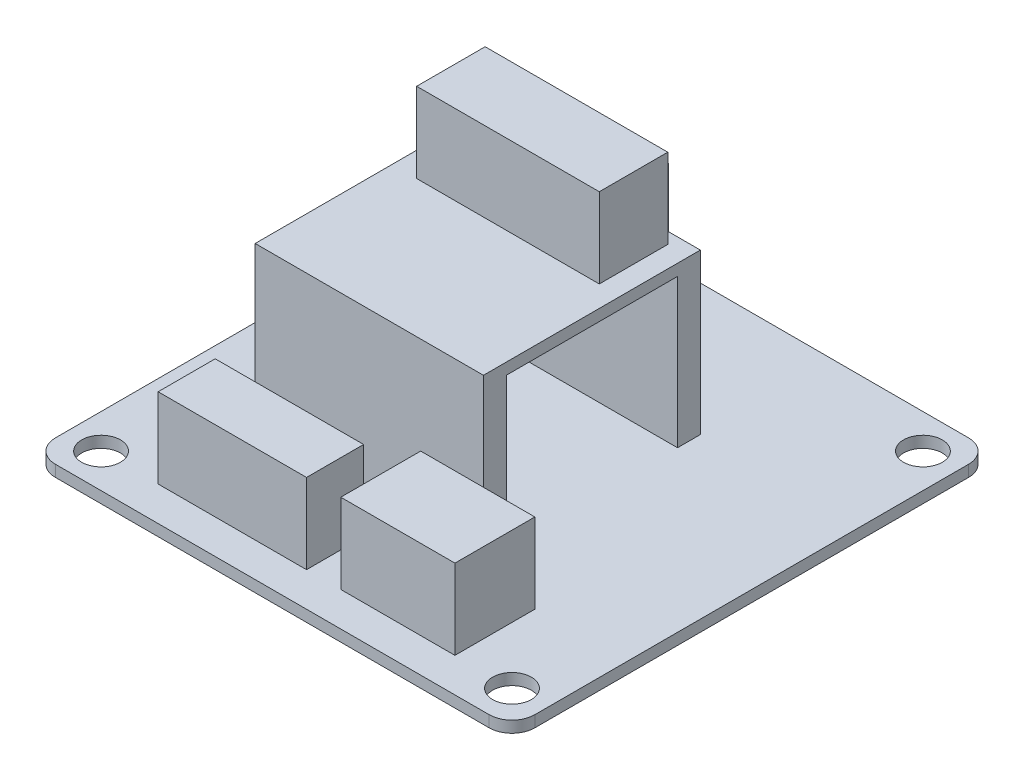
ISO-10303-21;
HEADER;
FILE_DESCRIPTION(('STEP AP214'),'2;1');
FILE_NAME('part.step','',(''),(''),'','','');
FILE_SCHEMA(('AUTOMOTIVE_DESIGN { 1 0 10303 214 1 1 1 1 }'));
ENDSEC;
DATA;
#1=APPLICATION_CONTEXT('core data for automotive mechanical design processes');
#2=APPLICATION_PROTOCOL_DEFINITION('international standard','automotive_design',2000,#1);
#3=PRODUCT_CONTEXT('',#1,'mechanical');
#4=PRODUCT('Part','Part','',(#3));
#5=PRODUCT_RELATED_PRODUCT_CATEGORY('part','',(#4));
#6=PRODUCT_DEFINITION_FORMATION('','',#4);
#7=PRODUCT_DEFINITION_CONTEXT('part definition',#1,'design');
#8=PRODUCT_DEFINITION('design','',#6,#7);
#9=PRODUCT_DEFINITION_SHAPE('','',#8);
#10=(LENGTH_UNIT() NAMED_UNIT(*) SI_UNIT(.MILLI.,.METRE.));
#11=(NAMED_UNIT(*) PLANE_ANGLE_UNIT() SI_UNIT($,.RADIAN.));
#12=(NAMED_UNIT(*) SI_UNIT($,.STERADIAN.) SOLID_ANGLE_UNIT());
#13=UNCERTAINTY_MEASURE_WITH_UNIT(LENGTH_MEASURE(1.E-05),#10,'distance_accuracy_value','');
#14=(GEOMETRIC_REPRESENTATION_CONTEXT(3) GLOBAL_UNCERTAINTY_ASSIGNED_CONTEXT((#13)) GLOBAL_UNIT_ASSIGNED_CONTEXT((#10,
#11,#12)) REPRESENTATION_CONTEXT('',''));
#15=CARTESIAN_POINT('',(0.,0.,0.));
#16=DIRECTION('',(0.,0.,1.));
#17=DIRECTION('',(1.,0.,0.));
#18=AXIS2_PLACEMENT_3D('',#15,#16,#17);
#19=CARTESIAN_POINT('',(0.,14.,0.));
#20=DIRECTION('',(0.,1.,0.));
#21=DIRECTION('',(0.,0.,1.));
#22=AXIS2_PLACEMENT_3D('',#19,#20,#21);
#23=PLANE('',#22);
#24=DIRECTION('',(0.,0.,1.));
#25=VECTOR('',#24,1.);
#26=CARTESIAN_POINT('',(-13.,14.,-9.5));
#27=LINE('',#26,#25);
#28=CARTESIAN_POINT('',(-13.,14.,-9.5));
#29=VERTEX_POINT('',#28);
#30=CARTESIAN_POINT('',(-13.,14.,9.5));
#31=VERTEX_POINT('',#30);
#32=EDGE_CURVE('E600',#29,#31,#27,.T.);
#33=ORIENTED_EDGE('',*,*,#32,.T.);
#34=DIRECTION('',(1.,0.,0.));
#35=VECTOR('',#34,1.);
#36=CARTESIAN_POINT('',(-13.,14.,9.5));
#37=LINE('',#36,#35);
#38=CARTESIAN_POINT('',(7.,14.,9.5));
#39=VERTEX_POINT('',#38);
#40=EDGE_CURVE('E603',#31,#39,#37,.T.);
#41=ORIENTED_EDGE('',*,*,#40,.T.);
#42=DIRECTION('',(0.,0.,-1.));
#43=VECTOR('',#42,1.);
#44=CARTESIAN_POINT('',(7.,14.,-9.5));
#45=LINE('',#44,#43);
#46=CARTESIAN_POINT('',(7.,14.,-9.5));
#47=VERTEX_POINT('',#46);
#48=EDGE_CURVE('E607',#39,#47,#45,.T.);
#49=ORIENTED_EDGE('',*,*,#48,.T.);
#50=DIRECTION('',(-1.,0.,0.));
#51=VECTOR('',#50,1.);
#52=CARTESIAN_POINT('',(-13.,14.,-9.5));
#53=LINE('',#52,#51);
#54=EDGE_CURVE('E610',#47,#29,#53,.T.);
#55=ORIENTED_EDGE('',*,*,#54,.T.);
#56=EDGE_LOOP('',(#33,#41,#49,#55));
#57=FACE_BOUND('',#56,.T.);
#58=DIRECTION('',(1.,0.,0.));
#59=VECTOR('',#58,1.);
#60=CARTESIAN_POINT('',(-10.8532061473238,14.,-2.5));
#61=LINE('',#60,#59);
#62=CARTESIAN_POINT('',(-10.8532061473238,14.,-2.5));
#63=VERTEX_POINT('',#62);
#64=CARTESIAN_POINT('',(5.1467938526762,14.,-2.5));
#65=VERTEX_POINT('',#64);
#66=EDGE_CURVE('E443',#63,#65,#61,.T.);
#67=ORIENTED_EDGE('',*,*,#66,.F.);
#68=DIRECTION('',(0.,0.,1.));
#69=VECTOR('',#68,1.);
#70=CARTESIAN_POINT('',(-10.8532061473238,14.,-8.5));
#71=LINE('',#70,#69);
#72=CARTESIAN_POINT('',(-10.8532061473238,14.,-8.5));
#73=VERTEX_POINT('',#72);
#74=EDGE_CURVE('E429',#73,#63,#71,.T.);
#75=ORIENTED_EDGE('',*,*,#74,.F.);
#76=DIRECTION('',(-1.,0.,0.));
#77=VECTOR('',#76,1.);
#78=CARTESIAN_POINT('',(-10.8532061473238,14.,-8.5));
#79=LINE('',#78,#77);
#80=CARTESIAN_POINT('',(5.1467938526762,14.,-8.5));
#81=VERTEX_POINT('',#80);
#82=EDGE_CURVE('E434',#81,#73,#79,.T.);
#83=ORIENTED_EDGE('',*,*,#82,.F.);
#84=DIRECTION('',(0.,0.,-1.));
#85=VECTOR('',#84,1.);
#86=CARTESIAN_POINT('',(5.1467938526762,14.,-8.5));
#87=LINE('',#86,#85);
#88=EDGE_CURVE('E445',#65,#81,#87,.T.);
#89=ORIENTED_EDGE('',*,*,#88,.F.);
#90=EDGE_LOOP('',(#67,#75,#83,#89));
#91=FACE_BOUND('',#90,.T.);
#92=ADVANCED_FACE('F42',(#57,#91),#23,.T.);
#93=CARTESIAN_POINT('',(0.,0.,0.));
#94=DIRECTION('',(0.,1.,0.));
#95=DIRECTION('',(0.,0.,1.));
#96=AXIS2_PLACEMENT_3D('',#93,#94,#95);
#97=PLANE('',#96);
#98=CARTESIAN_POINT('',(-18.,0.,18.));
#99=DIRECTION('',(0.,1.,0.));
#100=DIRECTION('',(0.,0.,-1.));
#101=AXIS2_PLACEMENT_3D('',#98,#99,#100);
#102=CIRCLE('',#101,1.69999999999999);
#103=CARTESIAN_POINT('',(-18.,0.,16.3));
#104=VERTEX_POINT('',#103);
#105=EDGE_CURVE('E677',#104,#104,#102,.T.);
#106=ORIENTED_EDGE('',*,*,#105,.F.);
#107=EDGE_LOOP('',(#106));
#108=FACE_BOUND('',#107,.T.);
#109=CARTESIAN_POINT('',(18.,0.,18.));
#110=DIRECTION('',(0.,1.,0.));
#111=DIRECTION('',(0.,0.,1.));
#112=AXIS2_PLACEMENT_3D('',#109,#110,#111);
#113=CIRCLE('',#112,1.69999999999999);
#114=CARTESIAN_POINT('',(18.,0.,19.7));
#115=VERTEX_POINT('',#114);
#116=EDGE_CURVE('E671',#115,#115,#113,.T.);
#117=ORIENTED_EDGE('',*,*,#116,.F.);
#118=EDGE_LOOP('',(#117));
#119=FACE_BOUND('',#118,.T.);
#120=CARTESIAN_POINT('',(18.,0.,-18.));
#121=DIRECTION('',(0.,1.,0.));
#122=DIRECTION('',(0.,0.,-1.));
#123=AXIS2_PLACEMENT_3D('',#120,#121,#122);
#124=CIRCLE('',#123,1.69999999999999);
#125=CARTESIAN_POINT('',(18.,0.,-19.7));
#126=VERTEX_POINT('',#125);
#127=EDGE_CURVE('E664',#126,#126,#124,.T.);
#128=ORIENTED_EDGE('',*,*,#127,.F.);
#129=EDGE_LOOP('',(#128));
#130=FACE_BOUND('',#129,.T.);
#131=CARTESIAN_POINT('',(-18.,0.,-18.));
#132=DIRECTION('',(0.,1.,0.));
#133=DIRECTION('',(0.,0.,1.));
#134=AXIS2_PLACEMENT_3D('',#131,#132,#133);
#135=CIRCLE('',#134,1.7);
#136=CARTESIAN_POINT('',(-18.,0.,-16.3));
#137=VERTEX_POINT('',#136);
#138=EDGE_CURVE('E667',#137,#137,#135,.T.);
#139=ORIENTED_EDGE('',*,*,#138,.F.);
#140=EDGE_LOOP('',(#139));
#141=FACE_BOUND('',#140,.T.);
#142=DIRECTION('',(-1.,0.,0.));
#143=VECTOR('',#142,1.);
#144=CARTESIAN_POINT('',(-21.,0.,-21.));
#145=LINE('',#144,#143);
#146=CARTESIAN_POINT('',(19.,0.,-21.));
#147=VERTEX_POINT('',#146);
#148=CARTESIAN_POINT('',(-19.,0.,-21.));
#149=VERTEX_POINT('',#148);
#150=EDGE_CURVE('E703',#147,#149,#145,.T.);
#151=ORIENTED_EDGE('',*,*,#150,.T.);
#152=CARTESIAN_POINT('',(-19.,0.,-19.));
#153=DIRECTION('',(0.,1.,0.));
#154=DIRECTION('',(0.,0.,1.));
#155=AXIS2_PLACEMENT_3D('',#152,#153,#154);
#156=CIRCLE('',#155,2.);
#157=CARTESIAN_POINT('',(-21.,0.,-19.));
#158=VERTEX_POINT('',#157);
#159=EDGE_CURVE('E721',#149,#158,#156,.T.);
#160=ORIENTED_EDGE('',*,*,#159,.T.);
#161=DIRECTION('',(0.,0.,1.));
#162=VECTOR('',#161,1.);
#163=CARTESIAN_POINT('',(-21.,0.,-21.));
#164=LINE('',#163,#162);
#165=CARTESIAN_POINT('',(-21.,0.,19.));
#166=VERTEX_POINT('',#165);
#167=EDGE_CURVE('E706',#158,#166,#164,.T.);
#168=ORIENTED_EDGE('',*,*,#167,.T.);
#169=CARTESIAN_POINT('',(-19.,0.,19.));
#170=DIRECTION('',(0.,1.,0.));
#171=DIRECTION('',(0.,0.,1.));
#172=AXIS2_PLACEMENT_3D('',#169,#170,#171);
#173=CIRCLE('',#172,2.);
#174=CARTESIAN_POINT('',(-19.,0.,21.));
#175=VERTEX_POINT('',#174);
#176=EDGE_CURVE('E719',#166,#175,#173,.T.);
#177=ORIENTED_EDGE('',*,*,#176,.T.);
#178=DIRECTION('',(1.,0.,0.));
#179=VECTOR('',#178,1.);
#180=CARTESIAN_POINT('',(-21.,0.,21.));
#181=LINE('',#180,#179);
#182=CARTESIAN_POINT('',(19.,0.,21.));
#183=VERTEX_POINT('',#182);
#184=EDGE_CURVE('E692',#175,#183,#181,.T.);
#185=ORIENTED_EDGE('',*,*,#184,.T.);
#186=CARTESIAN_POINT('',(19.,0.,19.));
#187=DIRECTION('',(0.,1.,0.));
#188=DIRECTION('',(0.,0.,1.));
#189=AXIS2_PLACEMENT_3D('',#186,#187,#188);
#190=CIRCLE('',#189,2.);
#191=CARTESIAN_POINT('',(21.,0.,19.));
#192=VERTEX_POINT('',#191);
#193=EDGE_CURVE('E717',#183,#192,#190,.T.);
#194=ORIENTED_EDGE('',*,*,#193,.T.);
#195=DIRECTION('',(0.,0.,-1.));
#196=VECTOR('',#195,1.);
#197=CARTESIAN_POINT('',(21.,0.,-21.));
#198=LINE('',#197,#196);
#199=CARTESIAN_POINT('',(21.,0.,-19.));
#200=VERTEX_POINT('',#199);
#201=EDGE_CURVE('E685',#192,#200,#198,.T.);
#202=ORIENTED_EDGE('',*,*,#201,.T.);
#203=CARTESIAN_POINT('',(19.,0.,-19.));
#204=DIRECTION('',(0.,1.,0.));
#205=DIRECTION('',(0.,0.,1.));
#206=AXIS2_PLACEMENT_3D('',#203,#204,#205);
#207=CIRCLE('',#206,2.);
#208=EDGE_CURVE('E715',#200,#147,#207,.T.);
#209=ORIENTED_EDGE('',*,*,#208,.T.);
#210=EDGE_LOOP('',(#151,#160,#168,#177,#185,#194,#202,#209));
#211=FACE_BOUND('',#210,.T.);
#212=DIRECTION('',(1.,0.,0.));
#213=VECTOR('',#212,1.);
#214=CARTESIAN_POINT('',(-13.,0.,-7.5));
#215=LINE('',#214,#213);
#216=CARTESIAN_POINT('',(-13.,0.,-7.5));
#217=VERTEX_POINT('',#216);
#218=CARTESIAN_POINT('',(7.,0.,-7.5));
#219=VERTEX_POINT('',#218);
#220=EDGE_CURVE('E648',#217,#219,#215,.T.);
#221=ORIENTED_EDGE('',*,*,#220,.F.);
#222=DIRECTION('',(0.,0.,1.));
#223=VECTOR('',#222,1.);
#224=CARTESIAN_POINT('',(-13.,0.,-9.5));
#225=LINE('',#224,#223);
#226=CARTESIAN_POINT('',(-13.,0.,-9.5));
#227=VERTEX_POINT('',#226);
#228=EDGE_CURVE('E638',#227,#217,#225,.T.);
#229=ORIENTED_EDGE('',*,*,#228,.F.);
#230=DIRECTION('',(-1.,0.,0.));
#231=VECTOR('',#230,1.);
#232=CARTESIAN_POINT('',(-13.,0.,-9.5));
#233=LINE('',#232,#231);
#234=CARTESIAN_POINT('',(7.,0.,-9.5));
#235=VERTEX_POINT('',#234);
#236=EDGE_CURVE('E645',#235,#227,#233,.T.);
#237=ORIENTED_EDGE('',*,*,#236,.F.);
#238=DIRECTION('',(0.,0.,-1.));
#239=VECTOR('',#238,1.);
#240=CARTESIAN_POINT('',(7.,0.,-9.5));
#241=LINE('',#240,#239);
#242=EDGE_CURVE('E650',#219,#235,#241,.T.);
#243=ORIENTED_EDGE('',*,*,#242,.F.);
#244=EDGE_LOOP('',(#221,#229,#237,#243));
#245=FACE_BOUND('',#244,.T.);
#246=DIRECTION('',(1.,0.,0.));
#247=VECTOR('',#246,1.);
#248=CARTESIAN_POINT('',(-13.,0.,9.5));
#249=LINE('',#248,#247);
#250=CARTESIAN_POINT('',(-13.,0.,9.5));
#251=VERTEX_POINT('',#250);
#252=CARTESIAN_POINT('',(7.,0.,9.5));
#253=VERTEX_POINT('',#252);
#254=EDGE_CURVE('E633',#251,#253,#249,.T.);
#255=ORIENTED_EDGE('',*,*,#254,.F.);
#256=DIRECTION('',(0.,0.,1.));
#257=VECTOR('',#256,1.);
#258=CARTESIAN_POINT('',(-13.,0.,9.5));
#259=LINE('',#258,#257);
#260=CARTESIAN_POINT('',(-13.,0.,7.5));
#261=VERTEX_POINT('',#260);
#262=EDGE_CURVE('E635',#261,#251,#259,.T.);
#263=ORIENTED_EDGE('',*,*,#262,.F.);
#264=DIRECTION('',(-1.,0.,0.));
#265=VECTOR('',#264,1.);
#266=CARTESIAN_POINT('',(-13.,0.,7.5));
#267=LINE('',#266,#265);
#268=CARTESIAN_POINT('',(7.,0.,7.5));
#269=VERTEX_POINT('',#268);
#270=EDGE_CURVE('E628',#269,#261,#267,.T.);
#271=ORIENTED_EDGE('',*,*,#270,.F.);
#272=DIRECTION('',(0.,0.,-1.));
#273=VECTOR('',#272,1.);
#274=CARTESIAN_POINT('',(7.,0.,9.5));
#275=LINE('',#274,#273);
#276=EDGE_CURVE('E630',#253,#269,#275,.T.);
#277=ORIENTED_EDGE('',*,*,#276,.F.);
#278=EDGE_LOOP('',(#255,#263,#271,#277));
#279=FACE_BOUND('',#278,.T.);
#280=DIRECTION('',(1.,0.,0.));
#281=VECTOR('',#280,1.);
#282=CARTESIAN_POINT('',(-13.,0.,18.));
#283=LINE('',#282,#281);
#284=CARTESIAN_POINT('',(-13.,0.,18.));
#285=VERTEX_POINT('',#284);
#286=CARTESIAN_POINT('',(0.,0.,18.));
#287=VERTEX_POINT('',#286);
#288=EDGE_CURVE('E584',#285,#287,#283,.T.);
#289=ORIENTED_EDGE('',*,*,#288,.F.);
#290=DIRECTION('',(0.,0.,1.));
#291=VECTOR('',#290,1.);
#292=CARTESIAN_POINT('',(-13.,0.,13.));
#293=LINE('',#292,#291);
#294=CARTESIAN_POINT('',(-13.,0.,13.));
#295=VERTEX_POINT('',#294);
#296=EDGE_CURVE('E570',#295,#285,#293,.T.);
#297=ORIENTED_EDGE('',*,*,#296,.F.);
#298=DIRECTION('',(-1.,0.,0.));
#299=VECTOR('',#298,1.);
#300=CARTESIAN_POINT('',(-13.,0.,13.));
#301=LINE('',#300,#299);
#302=CARTESIAN_POINT('',(0.,0.,13.));
#303=VERTEX_POINT('',#302);
#304=EDGE_CURVE('E575',#303,#295,#301,.T.);
#305=ORIENTED_EDGE('',*,*,#304,.F.);
#306=DIRECTION('',(0.,0.,-1.));
#307=VECTOR('',#306,1.);
#308=CARTESIAN_POINT('',(0.,0.,13.));
#309=LINE('',#308,#307);
#310=EDGE_CURVE('E586',#287,#303,#309,.T.);
#311=ORIENTED_EDGE('',*,*,#310,.F.);
#312=EDGE_LOOP('',(#289,#297,#305,#311));
#313=FACE_BOUND('',#312,.T.);
#314=DIRECTION('',(1.,0.,0.));
#315=VECTOR('',#314,1.);
#316=CARTESIAN_POINT('',(3.00000000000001,0.,18.));
#317=LINE('',#316,#315);
#318=CARTESIAN_POINT('',(3.00000000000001,0.,18.));
#319=VERTEX_POINT('',#318);
#320=CARTESIAN_POINT('',(13.,0.,18.));
#321=VERTEX_POINT('',#320);
#322=EDGE_CURVE('E555',#319,#321,#317,.T.);
#323=ORIENTED_EDGE('',*,*,#322,.F.);
#324=DIRECTION('',(0.,0.,1.));
#325=VECTOR('',#324,1.);
#326=CARTESIAN_POINT('',(3.,0.,11.));
#327=LINE('',#326,#325);
#328=CARTESIAN_POINT('',(3.,0.,11.));
#329=VERTEX_POINT('',#328);
#330=EDGE_CURVE('E541',#329,#319,#327,.T.);
#331=ORIENTED_EDGE('',*,*,#330,.F.);
#332=DIRECTION('',(-1.,0.,0.));
#333=VECTOR('',#332,1.);
#334=CARTESIAN_POINT('',(3.,0.,11.));
#335=LINE('',#334,#333);
#336=CARTESIAN_POINT('',(13.,0.,11.));
#337=VERTEX_POINT('',#336);
#338=EDGE_CURVE('E546',#337,#329,#335,.T.);
#339=ORIENTED_EDGE('',*,*,#338,.F.);
#340=DIRECTION('',(0.,0.,-1.));
#341=VECTOR('',#340,1.);
#342=CARTESIAN_POINT('',(13.,0.,11.));
#343=LINE('',#342,#341);
#344=EDGE_CURVE('E557',#321,#337,#343,.T.);
#345=ORIENTED_EDGE('',*,*,#344,.F.);
#346=EDGE_LOOP('',(#323,#331,#339,#345));
#347=FACE_BOUND('',#346,.T.);
#348=DIRECTION('',(-1.,0.,0.));
#349=VECTOR('',#348,1.);
#350=CARTESIAN_POINT('',(-12.,0.,-20.));
#351=LINE('',#350,#349);
#352=CARTESIAN_POINT('',(-4.,0.,-20.));
#353=VERTEX_POINT('',#352);
#354=CARTESIAN_POINT('',(-12.,0.,-20.));
#355=VERTEX_POINT('',#354);
#356=EDGE_CURVE('E526',#353,#355,#351,.T.);
#357=ORIENTED_EDGE('',*,*,#356,.F.);
#358=DIRECTION('',(0.,0.,-1.));
#359=VECTOR('',#358,1.);
#360=CARTESIAN_POINT('',(-4.,0.,-20.));
#361=LINE('',#360,#359);
#362=CARTESIAN_POINT('',(-4.,0.,-12.));
#363=VERTEX_POINT('',#362);
#364=EDGE_CURVE('E510',#363,#353,#361,.T.);
#365=ORIENTED_EDGE('',*,*,#364,.F.);
#366=DIRECTION('',(1.,0.,0.));
#367=VECTOR('',#366,1.);
#368=CARTESIAN_POINT('',(-12.,0.,-12.));
#369=LINE('',#368,#367);
#370=CARTESIAN_POINT('',(-12.,0.,-12.));
#371=VERTEX_POINT('',#370);
#372=EDGE_CURVE('E517',#371,#363,#369,.T.);
#373=ORIENTED_EDGE('',*,*,#372,.F.);
#374=DIRECTION('',(0.,0.,1.));
#375=VECTOR('',#374,1.);
#376=CARTESIAN_POINT('',(-12.,0.,-20.));
#377=LINE('',#376,#375);
#378=EDGE_CURVE('E528',#355,#371,#377,.T.);
#379=ORIENTED_EDGE('',*,*,#378,.F.);
#380=EDGE_LOOP('',(#357,#365,#373,#379));
#381=FACE_BOUND('',#380,.T.);
#382=ADVANCED_FACE('F747',(#108,#119,#130,#141,#211,#245,#279,#313,#347,#381),#97,.T.);
#383=CARTESIAN_POINT('',(21.,-1.,-21.));
#384=DIRECTION('',(1.,0.,0.));
#385=DIRECTION('',(0.,0.,-1.));
#386=AXIS2_PLACEMENT_3D('',#383,#384,#385);
#387=PLANE('',#386);
#388=ORIENTED_EDGE('',*,*,#201,.F.);
#389=DIRECTION('',(0.,1.,0.));
#390=VECTOR('',#389,1.);
#391=CARTESIAN_POINT('',(21.,-1.,19.));
#392=LINE('',#391,#390);
#393=CARTESIAN_POINT('',(21.,-1.,19.));
#394=VERTEX_POINT('',#393);
#395=EDGE_CURVE('E11',#192,#394,#392,.F.);
#396=ORIENTED_EDGE('',*,*,#395,.T.);
#397=DIRECTION('',(0.,0.,-1.));
#398=VECTOR('',#397,1.);
#399=CARTESIAN_POINT('',(21.,-1.,-21.));
#400=LINE('',#399,#398);
#401=CARTESIAN_POINT('',(21.,-1.,-19.));
#402=VERTEX_POINT('',#401);
#403=EDGE_CURVE('E688',#394,#402,#400,.T.);
#404=ORIENTED_EDGE('',*,*,#403,.T.);
#405=DIRECTION('',(0.,1.,0.));
#406=VECTOR('',#405,1.);
#407=CARTESIAN_POINT('',(21.,-1.,-19.));
#408=LINE('',#407,#406);
#409=EDGE_CURVE('E50',#402,#200,#408,.T.);
#410=ORIENTED_EDGE('',*,*,#409,.T.);
#411=EDGE_LOOP('',(#388,#396,#404,#410));
#412=FACE_BOUND('',#411,.T.);
#413=ADVANCED_FACE('F742',(#412),#387,.T.);
#414=CARTESIAN_POINT('',(-21.,-1.,21.));
#415=DIRECTION('',(0.,0.,1.));
#416=DIRECTION('',(1.,0.,0.));
#417=AXIS2_PLACEMENT_3D('',#414,#415,#416);
#418=PLANE('',#417);
#419=ORIENTED_EDGE('',*,*,#184,.F.);
#420=DIRECTION('',(0.,1.,0.));
#421=VECTOR('',#420,1.);
#422=CARTESIAN_POINT('',(-19.,-1.,21.));
#423=LINE('',#422,#421);
#424=CARTESIAN_POINT('',(-19.,-1.,21.));
#425=VERTEX_POINT('',#424);
#426=EDGE_CURVE('E64',#175,#425,#423,.F.);
#427=ORIENTED_EDGE('',*,*,#426,.T.);
#428=DIRECTION('',(1.,0.,0.));
#429=VECTOR('',#428,1.);
#430=CARTESIAN_POINT('',(-21.,-1.,21.));
#431=LINE('',#430,#429);
#432=CARTESIAN_POINT('',(19.,-1.,21.));
#433=VERTEX_POINT('',#432);
#434=EDGE_CURVE('E698',#425,#433,#431,.T.);
#435=ORIENTED_EDGE('',*,*,#434,.T.);
#436=DIRECTION('',(0.,1.,0.));
#437=VECTOR('',#436,1.);
#438=CARTESIAN_POINT('',(19.,-1.,21.));
#439=LINE('',#438,#437);
#440=EDGE_CURVE('E735',#433,#183,#439,.T.);
#441=ORIENTED_EDGE('',*,*,#440,.T.);
#442=EDGE_LOOP('',(#419,#427,#435,#441));
#443=FACE_BOUND('',#442,.T.);
#444=ADVANCED_FACE('F753',(#443),#418,.T.);
#445=CARTESIAN_POINT('',(-21.,-1.,-21.));
#446=DIRECTION('',(-1.,0.,0.));
#447=DIRECTION('',(0.,0.,1.));
#448=AXIS2_PLACEMENT_3D('',#445,#446,#447);
#449=PLANE('',#448);
#450=ORIENTED_EDGE('',*,*,#167,.F.);
#451=DIRECTION('',(0.,1.,0.));
#452=VECTOR('',#451,1.);
#453=CARTESIAN_POINT('',(-21.,-1.,-19.));
#454=LINE('',#453,#452);
#455=CARTESIAN_POINT('',(-21.,-1.,-19.));
#456=VERTEX_POINT('',#455);
#457=EDGE_CURVE('E726',#158,#456,#454,.F.);
#458=ORIENTED_EDGE('',*,*,#457,.T.);
#459=DIRECTION('',(0.,0.,1.));
#460=VECTOR('',#459,1.);
#461=CARTESIAN_POINT('',(-21.,-1.,-21.));
#462=LINE('',#461,#460);
#463=CARTESIAN_POINT('',(-21.,-1.,19.));
#464=VERTEX_POINT('',#463);
#465=EDGE_CURVE('E695',#456,#464,#462,.T.);
#466=ORIENTED_EDGE('',*,*,#465,.T.);
#467=DIRECTION('',(0.,1.,0.));
#468=VECTOR('',#467,1.);
#469=CARTESIAN_POINT('',(-21.,-1.,19.));
#470=LINE('',#469,#468);
#471=EDGE_CURVE('E723',#464,#166,#470,.T.);
#472=ORIENTED_EDGE('',*,*,#471,.T.);
#473=EDGE_LOOP('',(#450,#458,#466,#472));
#474=FACE_BOUND('',#473,.T.);
#475=ADVANCED_FACE('F762',(#474),#449,.T.);
#476=CARTESIAN_POINT('',(-21.,-1.,-21.));
#477=DIRECTION('',(0.,0.,-1.));
#478=DIRECTION('',(-1.,0.,0.));
#479=AXIS2_PLACEMENT_3D('',#476,#477,#478);
#480=PLANE('',#479);
#481=DIRECTION('',(-1.,0.,0.));
#482=VECTOR('',#481,1.);
#483=CARTESIAN_POINT('',(-21.,-1.,-21.));
#484=LINE('',#483,#482);
#485=CARTESIAN_POINT('',(19.,-1.,-21.));
#486=VERTEX_POINT('',#485);
#487=CARTESIAN_POINT('',(-19.,-1.,-21.));
#488=VERTEX_POINT('',#487);
#489=EDGE_CURVE('E691',#486,#488,#484,.T.);
#490=ORIENTED_EDGE('',*,*,#489,.T.);
#491=DIRECTION('',(0.,1.,0.));
#492=VECTOR('',#491,1.);
#493=CARTESIAN_POINT('',(-19.,-1.,-21.));
#494=LINE('',#493,#492);
#495=EDGE_CURVE('E712',#488,#149,#494,.T.);
#496=ORIENTED_EDGE('',*,*,#495,.T.);
#497=ORIENTED_EDGE('',*,*,#150,.F.);
#498=DIRECTION('',(0.,1.,0.));
#499=VECTOR('',#498,1.);
#500=CARTESIAN_POINT('',(19.,-1.,-21.));
#501=LINE('',#500,#499);
#502=EDGE_CURVE('E700',#147,#486,#501,.F.);
#503=ORIENTED_EDGE('',*,*,#502,.T.);
#504=EDGE_LOOP('',(#490,#496,#497,#503));
#505=FACE_BOUND('',#504,.T.);
#506=ADVANCED_FACE('F769',(#505),#480,.T.);
#507=CARTESIAN_POINT('',(0.,-1.,0.));
#508=DIRECTION('',(0.,1.,0.));
#509=DIRECTION('',(0.,0.,1.));
#510=AXIS2_PLACEMENT_3D('',#507,#508,#509);
#511=PLANE('',#510);
#512=CARTESIAN_POINT('',(-18.,-1.,18.));
#513=DIRECTION('',(0.,1.,0.));
#514=DIRECTION('',(0.,0.,-1.));
#515=AXIS2_PLACEMENT_3D('',#512,#513,#514);
#516=CIRCLE('',#515,1.69999999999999);
#517=CARTESIAN_POINT('',(-18.,-1.,16.3));
#518=VERTEX_POINT('',#517);
#519=EDGE_CURVE('E663',#518,#518,#516,.T.);
#520=ORIENTED_EDGE('',*,*,#519,.T.);
#521=EDGE_LOOP('',(#520));
#522=FACE_BOUND('',#521,.T.);
#523=CARTESIAN_POINT('',(18.,-1.,18.));
#524=DIRECTION('',(0.,1.,0.));
#525=DIRECTION('',(0.,0.,1.));
#526=AXIS2_PLACEMENT_3D('',#523,#524,#525);
#527=CIRCLE('',#526,1.69999999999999);
#528=CARTESIAN_POINT('',(18.,-1.,19.7));
#529=VERTEX_POINT('',#528);
#530=EDGE_CURVE('E674',#529,#529,#527,.T.);
#531=ORIENTED_EDGE('',*,*,#530,.T.);
#532=EDGE_LOOP('',(#531));
#533=FACE_BOUND('',#532,.T.);
#534=CARTESIAN_POINT('',(18.,-1.,-18.));
#535=DIRECTION('',(0.,1.,0.));
#536=DIRECTION('',(0.,0.,-1.));
#537=AXIS2_PLACEMENT_3D('',#534,#535,#536);
#538=CIRCLE('',#537,1.69999999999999);
#539=CARTESIAN_POINT('',(18.,-1.,-19.7));
#540=VERTEX_POINT('',#539);
#541=EDGE_CURVE('E668',#540,#540,#538,.T.);
#542=ORIENTED_EDGE('',*,*,#541,.T.);
#543=EDGE_LOOP('',(#542));
#544=FACE_BOUND('',#543,.T.);
#545=CARTESIAN_POINT('',(-18.,-1.,-18.));
#546=DIRECTION('',(0.,1.,0.));
#547=DIRECTION('',(0.,0.,1.));
#548=AXIS2_PLACEMENT_3D('',#545,#546,#547);
#549=CIRCLE('',#548,1.7);
#550=CARTESIAN_POINT('',(-18.,-1.,-16.3));
#551=VERTEX_POINT('',#550);
#552=EDGE_CURVE('E682',#551,#551,#549,.T.);
#553=ORIENTED_EDGE('',*,*,#552,.T.);
#554=EDGE_LOOP('',(#553));
#555=FACE_BOUND('',#554,.T.);
#556=ORIENTED_EDGE('',*,*,#465,.F.);
#557=CARTESIAN_POINT('',(-19.,-1.,-19.));
#558=DIRECTION('',(0.,1.,0.));
#559=DIRECTION('',(0.,0.,1.));
#560=AXIS2_PLACEMENT_3D('',#557,#558,#559);
#561=CIRCLE('',#560,2.);
#562=EDGE_CURVE('E733',#456,#488,#561,.F.);
#563=ORIENTED_EDGE('',*,*,#562,.T.);
#564=ORIENTED_EDGE('',*,*,#489,.F.);
#565=CARTESIAN_POINT('',(19.,-1.,-19.));
#566=DIRECTION('',(0.,1.,0.));
#567=DIRECTION('',(0.,0.,1.));
#568=AXIS2_PLACEMENT_3D('',#565,#566,#567);
#569=CIRCLE('',#568,2.);
#570=EDGE_CURVE('E728',#486,#402,#569,.F.);
#571=ORIENTED_EDGE('',*,*,#570,.T.);
#572=ORIENTED_EDGE('',*,*,#403,.F.);
#573=CARTESIAN_POINT('',(19.,-1.,19.));
#574=DIRECTION('',(0.,1.,0.));
#575=DIRECTION('',(0.,0.,1.));
#576=AXIS2_PLACEMENT_3D('',#573,#574,#575);
#577=CIRCLE('',#576,2.);
#578=EDGE_CURVE('E57',#394,#433,#577,.F.);
#579=ORIENTED_EDGE('',*,*,#578,.T.);
#580=ORIENTED_EDGE('',*,*,#434,.F.);
#581=CARTESIAN_POINT('',(-19.,-1.,19.));
#582=DIRECTION('',(0.,1.,0.));
#583=DIRECTION('',(0.,0.,1.));
#584=AXIS2_PLACEMENT_3D('',#581,#582,#583);
#585=CIRCLE('',#584,2.);
#586=EDGE_CURVE('E731',#425,#464,#585,.F.);
#587=ORIENTED_EDGE('',*,*,#586,.T.);
#588=EDGE_LOOP('',(#556,#563,#564,#571,#572,#579,#580,#587));
#589=FACE_BOUND('',#588,.T.);
#590=ADVANCED_FACE('F756',(#522,#533,#544,#555,#589),#511,.F.);
#591=CARTESIAN_POINT('',(-18.,-1.,-18.));
#592=DIRECTION('',(0.,1.,0.));
#593=DIRECTION('',(0.,0.,1.));
#594=AXIS2_PLACEMENT_3D('',#591,#592,#593);
#595=CYLINDRICAL_SURFACE('',#594,1.7);
#596=ORIENTED_EDGE('',*,*,#552,.F.);
#597=EDGE_LOOP('',(#596));
#598=FACE_BOUND('',#597,.T.);
#599=ORIENTED_EDGE('',*,*,#138,.T.);
#600=EDGE_LOOP('',(#599));
#601=FACE_BOUND('',#600,.T.);
#602=ADVANCED_FACE('F823',(#598,#601),#595,.F.);
#603=CARTESIAN_POINT('',(18.,-1.,-18.));
#604=DIRECTION('',(0.,1.,0.));
#605=DIRECTION('',(0.,0.,1.));
#606=AXIS2_PLACEMENT_3D('',#603,#604,#605);
#607=CYLINDRICAL_SURFACE('',#606,1.69999999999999);
#608=ORIENTED_EDGE('',*,*,#541,.F.);
#609=EDGE_LOOP('',(#608));
#610=FACE_BOUND('',#609,.T.);
#611=ORIENTED_EDGE('',*,*,#127,.T.);
#612=EDGE_LOOP('',(#611));
#613=FACE_BOUND('',#612,.T.);
#614=ADVANCED_FACE('F819',(#610,#613),#607,.F.);
#615=CARTESIAN_POINT('',(18.,-1.,18.));
#616=DIRECTION('',(0.,1.,0.));
#617=DIRECTION('',(0.,0.,1.));
#618=AXIS2_PLACEMENT_3D('',#615,#616,#617);
#619=CYLINDRICAL_SURFACE('',#618,1.69999999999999);
#620=ORIENTED_EDGE('',*,*,#530,.F.);
#621=EDGE_LOOP('',(#620));
#622=FACE_BOUND('',#621,.T.);
#623=ORIENTED_EDGE('',*,*,#116,.T.);
#624=EDGE_LOOP('',(#623));
#625=FACE_BOUND('',#624,.T.);
#626=ADVANCED_FACE('F822',(#622,#625),#619,.F.);
#627=CARTESIAN_POINT('',(-18.,-1.,18.));
#628=DIRECTION('',(0.,1.,0.));
#629=DIRECTION('',(0.,0.,1.));
#630=AXIS2_PLACEMENT_3D('',#627,#628,#629);
#631=CYLINDRICAL_SURFACE('',#630,1.69999999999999);
#632=ORIENTED_EDGE('',*,*,#519,.F.);
#633=EDGE_LOOP('',(#632));
#634=FACE_BOUND('',#633,.T.);
#635=ORIENTED_EDGE('',*,*,#105,.T.);
#636=EDGE_LOOP('',(#635));
#637=FACE_BOUND('',#636,.T.);
#638=ADVANCED_FACE('F817',(#634,#637),#631,.F.);
#639=CARTESIAN_POINT('',(-13.,13.,-9.5));
#640=DIRECTION('',(1.,0.,0.));
#641=DIRECTION('',(0.,0.,-1.));
#642=AXIS2_PLACEMENT_3D('',#639,#640,#641);
#643=PLANE('',#642);
#644=ORIENTED_EDGE('',*,*,#228,.T.);
#645=DIRECTION('',(0.,-1.,0.));
#646=VECTOR('',#645,1.);
#647=CARTESIAN_POINT('',(-13.,13.,-7.5));
#648=LINE('',#647,#646);
#649=CARTESIAN_POINT('',(-13.,13.,-7.5));
#650=VERTEX_POINT('',#649);
#651=EDGE_CURVE('E661',#650,#217,#648,.T.);
#652=ORIENTED_EDGE('',*,*,#651,.F.);
#653=DIRECTION('',(0.,0.,1.));
#654=VECTOR('',#653,1.);
#655=CARTESIAN_POINT('',(-13.,13.,-9.5));
#656=LINE('',#655,#654);
#657=CARTESIAN_POINT('',(-13.,13.,7.5));
#658=VERTEX_POINT('',#657);
#659=EDGE_CURVE('E599',#650,#658,#656,.T.);
#660=ORIENTED_EDGE('',*,*,#659,.T.);
#661=DIRECTION('',(0.,-1.,0.));
#662=VECTOR('',#661,1.);
#663=CARTESIAN_POINT('',(-13.,13.,7.5));
#664=LINE('',#663,#662);
#665=EDGE_CURVE('E624',#658,#261,#664,.T.);
#666=ORIENTED_EDGE('',*,*,#665,.T.);
#667=ORIENTED_EDGE('',*,*,#262,.T.);
#668=DIRECTION('',(0.,-1.,0.));
#669=VECTOR('',#668,1.);
#670=CARTESIAN_POINT('',(-13.,13.,9.5));
#671=LINE('',#670,#669);
#672=EDGE_CURVE('E613',#31,#251,#671,.T.);
#673=ORIENTED_EDGE('',*,*,#672,.F.);
#674=ORIENTED_EDGE('',*,*,#32,.F.);
#675=DIRECTION('',(0.,-1.,0.));
#676=VECTOR('',#675,1.);
#677=CARTESIAN_POINT('',(-13.,13.,-9.5));
#678=LINE('',#677,#676);
#679=EDGE_CURVE('E644',#29,#227,#678,.T.);
#680=ORIENTED_EDGE('',*,*,#679,.T.);
#681=EDGE_LOOP('',(#644,#652,#660,#666,#667,#673,#674,#680));
#682=FACE_BOUND('',#681,.T.);
#683=ADVANCED_FACE('F813',(#682),#643,.F.);
#684=CARTESIAN_POINT('',(-13.,13.,-7.5));
#685=DIRECTION('',(0.,0.,-1.));
#686=DIRECTION('',(-1.,0.,0.));
#687=AXIS2_PLACEMENT_3D('',#684,#685,#686);
#688=PLANE('',#687);
#689=ORIENTED_EDGE('',*,*,#220,.T.);
#690=DIRECTION('',(0.,-1.,0.));
#691=VECTOR('',#690,1.);
#692=CARTESIAN_POINT('',(7.,13.,-7.5));
#693=LINE('',#692,#691);
#694=CARTESIAN_POINT('',(7.,13.,-7.5));
#695=VERTEX_POINT('',#694);
#696=EDGE_CURVE('E658',#695,#219,#693,.T.);
#697=ORIENTED_EDGE('',*,*,#696,.F.);
#698=DIRECTION('',(1.,0.,0.));
#699=VECTOR('',#698,1.);
#700=CARTESIAN_POINT('',(-13.,13.,-7.5));
#701=LINE('',#700,#699);
#702=EDGE_CURVE('E641',#650,#695,#701,.T.);
#703=ORIENTED_EDGE('',*,*,#702,.F.);
#704=ORIENTED_EDGE('',*,*,#651,.T.);
#705=EDGE_LOOP('',(#689,#697,#703,#704));
#706=FACE_BOUND('',#705,.T.);
#707=ADVANCED_FACE('F809',(#706),#688,.F.);
#708=CARTESIAN_POINT('',(7.,13.,-9.5));
#709=DIRECTION('',(-1.,0.,0.));
#710=DIRECTION('',(0.,0.,1.));
#711=AXIS2_PLACEMENT_3D('',#708,#709,#710);
#712=PLANE('',#711);
#713=ORIENTED_EDGE('',*,*,#242,.T.);
#714=DIRECTION('',(0.,-1.,0.));
#715=VECTOR('',#714,1.);
#716=CARTESIAN_POINT('',(7.,13.,-9.5));
#717=LINE('',#716,#715);
#718=EDGE_CURVE('E656',#47,#235,#717,.T.);
#719=ORIENTED_EDGE('',*,*,#718,.F.);
#720=ORIENTED_EDGE('',*,*,#48,.F.);
#721=DIRECTION('',(0.,-1.,0.));
#722=VECTOR('',#721,1.);
#723=CARTESIAN_POINT('',(7.,13.,9.5));
#724=LINE('',#723,#722);
#725=EDGE_CURVE('E619',#39,#253,#724,.T.);
#726=ORIENTED_EDGE('',*,*,#725,.T.);
#727=ORIENTED_EDGE('',*,*,#276,.T.);
#728=DIRECTION('',(0.,-1.,0.));
#729=VECTOR('',#728,1.);
#730=CARTESIAN_POINT('',(7.,13.,7.5));
#731=LINE('',#730,#729);
#732=CARTESIAN_POINT('',(7.,13.,7.5));
#733=VERTEX_POINT('',#732);
#734=EDGE_CURVE('E622',#733,#269,#731,.T.);
#735=ORIENTED_EDGE('',*,*,#734,.F.);
#736=DIRECTION('',(0.,0.,-1.));
#737=VECTOR('',#736,1.);
#738=CARTESIAN_POINT('',(7.,13.,-9.5));
#739=LINE('',#738,#737);
#740=EDGE_CURVE('E604',#733,#695,#739,.T.);
#741=ORIENTED_EDGE('',*,*,#740,.T.);
#742=ORIENTED_EDGE('',*,*,#696,.T.);
#743=EDGE_LOOP('',(#713,#719,#720,#726,#727,#735,#741,#742));
#744=FACE_BOUND('',#743,.T.);
#745=ADVANCED_FACE('F805',(#744),#712,.F.);
#746=CARTESIAN_POINT('',(-13.,13.,-9.5));
#747=DIRECTION('',(0.,0.,1.));
#748=DIRECTION('',(1.,0.,0.));
#749=AXIS2_PLACEMENT_3D('',#746,#747,#748);
#750=PLANE('',#749);
#751=ORIENTED_EDGE('',*,*,#236,.T.);
#752=ORIENTED_EDGE('',*,*,#679,.F.);
#753=ORIENTED_EDGE('',*,*,#54,.F.);
#754=ORIENTED_EDGE('',*,*,#718,.T.);
#755=EDGE_LOOP('',(#751,#752,#753,#754));
#756=FACE_BOUND('',#755,.T.);
#757=ADVANCED_FACE('F798',(#756),#750,.F.);
#758=CARTESIAN_POINT('',(-13.,13.,9.5));
#759=DIRECTION('',(0.,0.,-1.));
#760=DIRECTION('',(-1.,0.,0.));
#761=AXIS2_PLACEMENT_3D('',#758,#759,#760);
#762=PLANE('',#761);
#763=ORIENTED_EDGE('',*,*,#254,.T.);
#764=ORIENTED_EDGE('',*,*,#725,.F.);
#765=ORIENTED_EDGE('',*,*,#40,.F.);
#766=ORIENTED_EDGE('',*,*,#672,.T.);
#767=EDGE_LOOP('',(#763,#764,#765,#766));
#768=FACE_BOUND('',#767,.T.);
#769=ADVANCED_FACE('F795',(#768),#762,.F.);
#770=CARTESIAN_POINT('',(-13.,13.,7.5));
#771=DIRECTION('',(0.,0.,1.));
#772=DIRECTION('',(1.,0.,0.));
#773=AXIS2_PLACEMENT_3D('',#770,#771,#772);
#774=PLANE('',#773);
#775=ORIENTED_EDGE('',*,*,#270,.T.);
#776=ORIENTED_EDGE('',*,*,#665,.F.);
#777=DIRECTION('',(-1.,0.,0.));
#778=VECTOR('',#777,1.);
#779=CARTESIAN_POINT('',(-13.,13.,7.5));
#780=LINE('',#779,#778);
#781=EDGE_CURVE('E627',#733,#658,#780,.T.);
#782=ORIENTED_EDGE('',*,*,#781,.F.);
#783=ORIENTED_EDGE('',*,*,#734,.T.);
#784=EDGE_LOOP('',(#775,#776,#782,#783));
#785=FACE_BOUND('',#784,.T.);
#786=ADVANCED_FACE('F793',(#785),#774,.F.);
#787=CARTESIAN_POINT('',(0.,13.,0.));
#788=DIRECTION('',(0.,1.,0.));
#789=DIRECTION('',(0.,0.,1.));
#790=AXIS2_PLACEMENT_3D('',#787,#788,#789);
#791=PLANE('',#790);
#792=ORIENTED_EDGE('',*,*,#659,.F.);
#793=ORIENTED_EDGE('',*,*,#702,.T.);
#794=ORIENTED_EDGE('',*,*,#740,.F.);
#795=ORIENTED_EDGE('',*,*,#781,.T.);
#796=EDGE_LOOP('',(#792,#793,#794,#795));
#797=FACE_BOUND('',#796,.T.);
#798=ADVANCED_FACE('F790',(#797),#791,.F.);
#799=CARTESIAN_POINT('',(-13.,7.,13.));
#800=DIRECTION('',(1.,0.,0.));
#801=DIRECTION('',(0.,0.,-1.));
#802=AXIS2_PLACEMENT_3D('',#799,#800,#801);
#803=PLANE('',#802);
#804=ORIENTED_EDGE('',*,*,#296,.T.);
#805=DIRECTION('',(0.,-1.,0.));
#806=VECTOR('',#805,1.);
#807=CARTESIAN_POINT('',(-13.,7.,18.));
#808=LINE('',#807,#806);
#809=CARTESIAN_POINT('',(-13.,7.,18.));
#810=VERTEX_POINT('',#809);
#811=EDGE_CURVE('E597',#810,#285,#808,.T.);
#812=ORIENTED_EDGE('',*,*,#811,.F.);
#813=DIRECTION('',(0.,0.,1.));
#814=VECTOR('',#813,1.);
#815=CARTESIAN_POINT('',(-13.,7.,13.));
#816=LINE('',#815,#814);
#817=CARTESIAN_POINT('',(-13.,7.,13.));
#818=VERTEX_POINT('',#817);
#819=EDGE_CURVE('E571',#818,#810,#816,.T.);
#820=ORIENTED_EDGE('',*,*,#819,.F.);
#821=DIRECTION('',(0.,-1.,0.));
#822=VECTOR('',#821,1.);
#823=CARTESIAN_POINT('',(-13.,7.,13.));
#824=LINE('',#823,#822);
#825=EDGE_CURVE('E581',#818,#295,#824,.T.);
#826=ORIENTED_EDGE('',*,*,#825,.T.);
#827=EDGE_LOOP('',(#804,#812,#820,#826));
#828=FACE_BOUND('',#827,.T.);
#829=ADVANCED_FACE('F788',(#828),#803,.F.);
#830=CARTESIAN_POINT('',(-13.,7.,18.));
#831=DIRECTION('',(0.,0.,-1.));
#832=DIRECTION('',(-1.,0.,0.));
#833=AXIS2_PLACEMENT_3D('',#830,#831,#832);
#834=PLANE('',#833);
#835=ORIENTED_EDGE('',*,*,#288,.T.);
#836=DIRECTION('',(0.,-1.,0.));
#837=VECTOR('',#836,1.);
#838=CARTESIAN_POINT('',(0.,7.,18.));
#839=LINE('',#838,#837);
#840=CARTESIAN_POINT('',(0.,7.,18.));
#841=VERTEX_POINT('',#840);
#842=EDGE_CURVE('E594',#841,#287,#839,.T.);
#843=ORIENTED_EDGE('',*,*,#842,.F.);
#844=DIRECTION('',(1.,0.,0.));
#845=VECTOR('',#844,1.);
#846=CARTESIAN_POINT('',(-13.,7.,18.));
#847=LINE('',#846,#845);
#848=EDGE_CURVE('E574',#810,#841,#847,.T.);
#849=ORIENTED_EDGE('',*,*,#848,.F.);
#850=ORIENTED_EDGE('',*,*,#811,.T.);
#851=EDGE_LOOP('',(#835,#843,#849,#850));
#852=FACE_BOUND('',#851,.T.);
#853=ADVANCED_FACE('F1423',(#852),#834,.F.);
#854=CARTESIAN_POINT('',(0.,7.,13.));
#855=DIRECTION('',(-1.,0.,0.));
#856=DIRECTION('',(0.,0.,1.));
#857=AXIS2_PLACEMENT_3D('',#854,#855,#856);
#858=PLANE('',#857);
#859=ORIENTED_EDGE('',*,*,#310,.T.);
#860=DIRECTION('',(0.,-1.,0.));
#861=VECTOR('',#860,1.);
#862=CARTESIAN_POINT('',(0.,7.,13.));
#863=LINE('',#862,#861);
#864=CARTESIAN_POINT('',(0.,7.,13.));
#865=VERTEX_POINT('',#864);
#866=EDGE_CURVE('E592',#865,#303,#863,.T.);
#867=ORIENTED_EDGE('',*,*,#866,.F.);
#868=DIRECTION('',(0.,0.,-1.));
#869=VECTOR('',#868,1.);
#870=CARTESIAN_POINT('',(0.,7.,13.));
#871=LINE('',#870,#869);
#872=EDGE_CURVE('E577',#841,#865,#871,.T.);
#873=ORIENTED_EDGE('',*,*,#872,.F.);
#874=ORIENTED_EDGE('',*,*,#842,.T.);
#875=EDGE_LOOP('',(#859,#867,#873,#874));
#876=FACE_BOUND('',#875,.T.);
#877=ADVANCED_FACE('F1413',(#876),#858,.F.);
#878=CARTESIAN_POINT('',(-13.,7.,13.));
#879=DIRECTION('',(0.,0.,1.));
#880=DIRECTION('',(1.,0.,0.));
#881=AXIS2_PLACEMENT_3D('',#878,#879,#880);
#882=PLANE('',#881);
#883=ORIENTED_EDGE('',*,*,#304,.T.);
#884=ORIENTED_EDGE('',*,*,#825,.F.);
#885=DIRECTION('',(-1.,0.,0.));
#886=VECTOR('',#885,1.);
#887=CARTESIAN_POINT('',(-13.,7.,13.));
#888=LINE('',#887,#886);
#889=EDGE_CURVE('E579',#865,#818,#888,.T.);
#890=ORIENTED_EDGE('',*,*,#889,.F.);
#891=ORIENTED_EDGE('',*,*,#866,.T.);
#892=EDGE_LOOP('',(#883,#884,#890,#891));
#893=FACE_BOUND('',#892,.T.);
#894=ADVANCED_FACE('F1403',(#893),#882,.F.);
#895=CARTESIAN_POINT('',(0.,7.,0.));
#896=DIRECTION('',(0.,1.,0.));
#897=DIRECTION('',(0.,0.,1.));
#898=AXIS2_PLACEMENT_3D('',#895,#896,#897);
#899=PLANE('',#898);
#900=ORIENTED_EDGE('',*,*,#819,.T.);
#901=ORIENTED_EDGE('',*,*,#848,.T.);
#902=ORIENTED_EDGE('',*,*,#872,.T.);
#903=ORIENTED_EDGE('',*,*,#889,.T.);
#904=EDGE_LOOP('',(#900,#901,#902,#903));
#905=FACE_BOUND('',#904,.T.);
#906=ADVANCED_FACE('F1393',(#905),#899,.T.);
#907=CARTESIAN_POINT('',(3.,7.,11.));
#908=DIRECTION('',(1.,0.,0.));
#909=DIRECTION('',(0.,0.,-1.));
#910=AXIS2_PLACEMENT_3D('',#907,#908,#909);
#911=PLANE('',#910);
#912=ORIENTED_EDGE('',*,*,#330,.T.);
#913=DIRECTION('',(0.,-1.,0.));
#914=VECTOR('',#913,1.);
#915=CARTESIAN_POINT('',(3.00000000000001,7.,18.));
#916=LINE('',#915,#914);
#917=CARTESIAN_POINT('',(3.00000000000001,7.,18.));
#918=VERTEX_POINT('',#917);
#919=EDGE_CURVE('E568',#918,#319,#916,.T.);
#920=ORIENTED_EDGE('',*,*,#919,.F.);
#921=DIRECTION('',(0.,0.,1.));
#922=VECTOR('',#921,1.);
#923=CARTESIAN_POINT('',(3.,7.,11.));
#924=LINE('',#923,#922);
#925=CARTESIAN_POINT('',(3.,7.,11.));
#926=VERTEX_POINT('',#925);
#927=EDGE_CURVE('E542',#926,#918,#924,.T.);
#928=ORIENTED_EDGE('',*,*,#927,.F.);
#929=DIRECTION('',(0.,-1.,0.));
#930=VECTOR('',#929,1.);
#931=CARTESIAN_POINT('',(3.,7.,11.));
#932=LINE('',#931,#930);
#933=EDGE_CURVE('E552',#926,#329,#932,.T.);
#934=ORIENTED_EDGE('',*,*,#933,.T.);
#935=EDGE_LOOP('',(#912,#920,#928,#934));
#936=FACE_BOUND('',#935,.T.);
#937=ADVANCED_FACE('F1383',(#936),#911,.F.);
#938=CARTESIAN_POINT('',(3.00000000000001,7.,18.));
#939=DIRECTION('',(0.,0.,-1.));
#940=DIRECTION('',(-1.,0.,0.));
#941=AXIS2_PLACEMENT_3D('',#938,#939,#940);
#942=PLANE('',#941);
#943=ORIENTED_EDGE('',*,*,#322,.T.);
#944=DIRECTION('',(0.,-1.,0.));
#945=VECTOR('',#944,1.);
#946=CARTESIAN_POINT('',(13.,7.,18.));
#947=LINE('',#946,#945);
#948=CARTESIAN_POINT('',(13.,7.,18.));
#949=VERTEX_POINT('',#948);
#950=EDGE_CURVE('E565',#949,#321,#947,.T.);
#951=ORIENTED_EDGE('',*,*,#950,.F.);
#952=DIRECTION('',(1.,0.,0.));
#953=VECTOR('',#952,1.);
#954=CARTESIAN_POINT('',(3.00000000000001,7.,18.));
#955=LINE('',#954,#953);
#956=EDGE_CURVE('E545',#918,#949,#955,.T.);
#957=ORIENTED_EDGE('',*,*,#956,.F.);
#958=ORIENTED_EDGE('',*,*,#919,.T.);
#959=EDGE_LOOP('',(#943,#951,#957,#958));
#960=FACE_BOUND('',#959,.T.);
#961=ADVANCED_FACE('F1373',(#960),#942,.F.);
#962=CARTESIAN_POINT('',(13.,7.,11.));
#963=DIRECTION('',(-1.,0.,0.));
#964=DIRECTION('',(0.,0.,1.));
#965=AXIS2_PLACEMENT_3D('',#962,#963,#964);
#966=PLANE('',#965);
#967=ORIENTED_EDGE('',*,*,#344,.T.);
#968=DIRECTION('',(0.,-1.,0.));
#969=VECTOR('',#968,1.);
#970=CARTESIAN_POINT('',(13.,7.,11.));
#971=LINE('',#970,#969);
#972=CARTESIAN_POINT('',(13.,7.,11.));
#973=VERTEX_POINT('',#972);
#974=EDGE_CURVE('E563',#973,#337,#971,.T.);
#975=ORIENTED_EDGE('',*,*,#974,.F.);
#976=DIRECTION('',(0.,0.,-1.));
#977=VECTOR('',#976,1.);
#978=CARTESIAN_POINT('',(13.,7.,11.));
#979=LINE('',#978,#977);
#980=EDGE_CURVE('E548',#949,#973,#979,.T.);
#981=ORIENTED_EDGE('',*,*,#980,.F.);
#982=ORIENTED_EDGE('',*,*,#950,.T.);
#983=EDGE_LOOP('',(#967,#975,#981,#982));
#984=FACE_BOUND('',#983,.T.);
#985=ADVANCED_FACE('F1363',(#984),#966,.F.);
#986=CARTESIAN_POINT('',(3.,7.,11.));
#987=DIRECTION('',(0.,0.,1.));
#988=DIRECTION('',(1.,0.,0.));
#989=AXIS2_PLACEMENT_3D('',#986,#987,#988);
#990=PLANE('',#989);
#991=ORIENTED_EDGE('',*,*,#338,.T.);
#992=ORIENTED_EDGE('',*,*,#933,.F.);
#993=DIRECTION('',(-1.,0.,0.));
#994=VECTOR('',#993,1.);
#995=CARTESIAN_POINT('',(3.,7.,11.));
#996=LINE('',#995,#994);
#997=EDGE_CURVE('E550',#973,#926,#996,.T.);
#998=ORIENTED_EDGE('',*,*,#997,.F.);
#999=ORIENTED_EDGE('',*,*,#974,.T.);
#1000=EDGE_LOOP('',(#991,#992,#998,#999));
#1001=FACE_BOUND('',#1000,.T.);
#1002=ADVANCED_FACE('F1353',(#1001),#990,.F.);
#1003=CARTESIAN_POINT('',(0.,7.,0.));
#1004=DIRECTION('',(0.,1.,0.));
#1005=DIRECTION('',(0.,0.,1.));
#1006=AXIS2_PLACEMENT_3D('',#1003,#1004,#1005);
#1007=PLANE('',#1006);
#1008=ORIENTED_EDGE('',*,*,#927,.T.);
#1009=ORIENTED_EDGE('',*,*,#956,.T.);
#1010=ORIENTED_EDGE('',*,*,#980,.T.);
#1011=ORIENTED_EDGE('',*,*,#997,.T.);
#1012=EDGE_LOOP('',(#1008,#1009,#1010,#1011));
#1013=FACE_BOUND('',#1012,.T.);
#1014=ADVANCED_FACE('F1335',(#1013),#1007,.T.);
#1015=CARTESIAN_POINT('',(-4.,2.,-20.));
#1016=DIRECTION('',(-1.,0.,0.));
#1017=DIRECTION('',(0.,0.,1.));
#1018=AXIS2_PLACEMENT_3D('',#1015,#1016,#1017);
#1019=PLANE('',#1018);
#1020=ORIENTED_EDGE('',*,*,#364,.T.);
#1021=DIRECTION('',(0.,-1.,0.));
#1022=VECTOR('',#1021,1.);
#1023=CARTESIAN_POINT('',(-4.,2.,-20.));
#1024=LINE('',#1023,#1022);
#1025=CARTESIAN_POINT('',(-4.,2.,-20.));
#1026=VERTEX_POINT('',#1025);
#1027=EDGE_CURVE('E539',#1026,#353,#1024,.T.);
#1028=ORIENTED_EDGE('',*,*,#1027,.F.);
#1029=DIRECTION('',(0.,0.,-1.));
#1030=VECTOR('',#1029,1.);
#1031=CARTESIAN_POINT('',(-4.,2.,-20.));
#1032=LINE('',#1031,#1030);
#1033=CARTESIAN_POINT('',(-4.,2.,-12.));
#1034=VERTEX_POINT('',#1033);
#1035=EDGE_CURVE('E513',#1034,#1026,#1032,.T.);
#1036=ORIENTED_EDGE('',*,*,#1035,.F.);
#1037=DIRECTION('',(0.,-1.,0.));
#1038=VECTOR('',#1037,1.);
#1039=CARTESIAN_POINT('',(-4.,2.,-12.));
#1040=LINE('',#1039,#1038);
#1041=EDGE_CURVE('E523',#1034,#363,#1040,.T.);
#1042=ORIENTED_EDGE('',*,*,#1041,.T.);
#1043=EDGE_LOOP('',(#1020,#1028,#1036,#1042));
#1044=FACE_BOUND('',#1043,.T.);
#1045=ADVANCED_FACE('F1325',(#1044),#1019,.F.);
#1046=CARTESIAN_POINT('',(-12.,2.,-20.));
#1047=DIRECTION('',(0.,0.,1.));
#1048=DIRECTION('',(1.,0.,0.));
#1049=AXIS2_PLACEMENT_3D('',#1046,#1047,#1048);
#1050=PLANE('',#1049);
#1051=ORIENTED_EDGE('',*,*,#356,.T.);
#1052=DIRECTION('',(0.,-1.,0.));
#1053=VECTOR('',#1052,1.);
#1054=CARTESIAN_POINT('',(-12.,2.,-20.));
#1055=LINE('',#1054,#1053);
#1056=CARTESIAN_POINT('',(-12.,2.,-20.));
#1057=VERTEX_POINT('',#1056);
#1058=EDGE_CURVE('E536',#1057,#355,#1055,.T.);
#1059=ORIENTED_EDGE('',*,*,#1058,.F.);
#1060=DIRECTION('',(-1.,0.,0.));
#1061=VECTOR('',#1060,1.);
#1062=CARTESIAN_POINT('',(-12.,2.,-20.));
#1063=LINE('',#1062,#1061);
#1064=EDGE_CURVE('E516',#1026,#1057,#1063,.T.);
#1065=ORIENTED_EDGE('',*,*,#1064,.F.);
#1066=ORIENTED_EDGE('',*,*,#1027,.T.);
#1067=EDGE_LOOP('',(#1051,#1059,#1065,#1066));
#1068=FACE_BOUND('',#1067,.T.);
#1069=ADVANCED_FACE('F1315',(#1068),#1050,.F.);
#1070=CARTESIAN_POINT('',(-12.,2.,-20.));
#1071=DIRECTION('',(1.,0.,0.));
#1072=DIRECTION('',(0.,0.,-1.));
#1073=AXIS2_PLACEMENT_3D('',#1070,#1071,#1072);
#1074=PLANE('',#1073);
#1075=ORIENTED_EDGE('',*,*,#378,.T.);
#1076=DIRECTION('',(0.,-1.,0.));
#1077=VECTOR('',#1076,1.);
#1078=CARTESIAN_POINT('',(-12.,2.,-12.));
#1079=LINE('',#1078,#1077);
#1080=CARTESIAN_POINT('',(-12.,2.,-12.));
#1081=VERTEX_POINT('',#1080);
#1082=EDGE_CURVE('E534',#1081,#371,#1079,.T.);
#1083=ORIENTED_EDGE('',*,*,#1082,.F.);
#1084=DIRECTION('',(0.,0.,1.));
#1085=VECTOR('',#1084,1.);
#1086=CARTESIAN_POINT('',(-12.,2.,-20.));
#1087=LINE('',#1086,#1085);
#1088=EDGE_CURVE('E519',#1057,#1081,#1087,.T.);
#1089=ORIENTED_EDGE('',*,*,#1088,.F.);
#1090=ORIENTED_EDGE('',*,*,#1058,.T.);
#1091=EDGE_LOOP('',(#1075,#1083,#1089,#1090));
#1092=FACE_BOUND('',#1091,.T.);
#1093=ADVANCED_FACE('F1305',(#1092),#1074,.F.);
#1094=CARTESIAN_POINT('',(-12.,2.,-12.));
#1095=DIRECTION('',(0.,0.,-1.));
#1096=DIRECTION('',(-1.,0.,0.));
#1097=AXIS2_PLACEMENT_3D('',#1094,#1095,#1096);
#1098=PLANE('',#1097);
#1099=ORIENTED_EDGE('',*,*,#372,.T.);
#1100=ORIENTED_EDGE('',*,*,#1041,.F.);
#1101=DIRECTION('',(1.,0.,0.));
#1102=VECTOR('',#1101,1.);
#1103=CARTESIAN_POINT('',(-12.,2.,-12.));
#1104=LINE('',#1103,#1102);
#1105=EDGE_CURVE('E521',#1081,#1034,#1104,.T.);
#1106=ORIENTED_EDGE('',*,*,#1105,.F.);
#1107=ORIENTED_EDGE('',*,*,#1082,.T.);
#1108=EDGE_LOOP('',(#1099,#1100,#1106,#1107));
#1109=FACE_BOUND('',#1108,.T.);
#1110=ADVANCED_FACE('F1295',(#1109),#1098,.F.);
#1111=CARTESIAN_POINT('',(0.,2.,0.));
#1112=DIRECTION('',(0.,1.,0.));
#1113=DIRECTION('',(0.,0.,1.));
#1114=AXIS2_PLACEMENT_3D('',#1111,#1112,#1113);
#1115=PLANE('',#1114);
#1116=CARTESIAN_POINT('',(-10.3999999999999,2.,-13.2));
#1117=DIRECTION('',(0.,1.,0.));
#1118=DIRECTION('',(0.,0.,1.));
#1119=AXIS2_PLACEMENT_3D('',#1116,#1117,#1118);
#1120=CIRCLE('',#1119,0.349999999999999);
#1121=CARTESIAN_POINT('',(-10.3999999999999,2.,-12.85));
#1122=VERTEX_POINT('',#1121);
#1123=EDGE_CURVE('E459',#1122,#1122,#1120,.T.);
#1124=ORIENTED_EDGE('',*,*,#1123,.F.);
#1125=EDGE_LOOP('',(#1124));
#1126=FACE_BOUND('',#1125,.T.);
#1127=CARTESIAN_POINT('',(-10.4,2.,-15.8));
#1128=DIRECTION('',(0.,1.,0.));
#1129=DIRECTION('',(0.,0.,1.));
#1130=AXIS2_PLACEMENT_3D('',#1127,#1128,#1129);
#1131=CIRCLE('',#1130,0.349999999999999);
#1132=CARTESIAN_POINT('',(-10.4,2.,-15.45));
#1133=VERTEX_POINT('',#1132);
#1134=EDGE_CURVE('E465',#1133,#1133,#1131,.T.);
#1135=ORIENTED_EDGE('',*,*,#1134,.F.);
#1136=EDGE_LOOP('',(#1135));
#1137=FACE_BOUND('',#1136,.T.);
#1138=CARTESIAN_POINT('',(-5.19999999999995,2.,-13.2));
#1139=DIRECTION('',(0.,1.,0.));
#1140=DIRECTION('',(0.,0.,1.));
#1141=AXIS2_PLACEMENT_3D('',#1138,#1139,#1140);
#1142=CIRCLE('',#1141,0.35);
#1143=CARTESIAN_POINT('',(-5.19999999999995,2.,-12.85));
#1144=VERTEX_POINT('',#1143);
#1145=EDGE_CURVE('E471',#1144,#1144,#1142,.T.);
#1146=ORIENTED_EDGE('',*,*,#1145,.F.);
#1147=EDGE_LOOP('',(#1146));
#1148=FACE_BOUND('',#1147,.T.);
#1149=CARTESIAN_POINT('',(-7.79999999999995,2.,-13.2));
#1150=DIRECTION('',(0.,1.,0.));
#1151=DIRECTION('',(0.,0.,1.));
#1152=AXIS2_PLACEMENT_3D('',#1149,#1150,#1151);
#1153=CIRCLE('',#1152,0.35);
#1154=CARTESIAN_POINT('',(-7.79999999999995,2.,-12.85));
#1155=VERTEX_POINT('',#1154);
#1156=EDGE_CURVE('E477',#1155,#1155,#1153,.T.);
#1157=ORIENTED_EDGE('',*,*,#1156,.F.);
#1158=EDGE_LOOP('',(#1157));
#1159=FACE_BOUND('',#1158,.T.);
#1160=CARTESIAN_POINT('',(-5.19999999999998,2.,-15.8));
#1161=DIRECTION('',(0.,1.,0.));
#1162=DIRECTION('',(0.,0.,1.));
#1163=AXIS2_PLACEMENT_3D('',#1160,#1161,#1162);
#1164=CIRCLE('',#1163,0.35);
#1165=CARTESIAN_POINT('',(-5.19999999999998,2.,-15.45));
#1166=VERTEX_POINT('',#1165);
#1167=EDGE_CURVE('E483',#1166,#1166,#1164,.T.);
#1168=ORIENTED_EDGE('',*,*,#1167,.F.);
#1169=EDGE_LOOP('',(#1168));
#1170=FACE_BOUND('',#1169,.T.);
#1171=CARTESIAN_POINT('',(-7.79999999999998,2.,-15.8));
#1172=DIRECTION('',(0.,1.,0.));
#1173=DIRECTION('',(0.,0.,1.));
#1174=AXIS2_PLACEMENT_3D('',#1171,#1172,#1173);
#1175=CIRCLE('',#1174,0.35);
#1176=CARTESIAN_POINT('',(-7.79999999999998,2.,-15.45));
#1177=VERTEX_POINT('',#1176);
#1178=EDGE_CURVE('E489',#1177,#1177,#1175,.T.);
#1179=ORIENTED_EDGE('',*,*,#1178,.F.);
#1180=EDGE_LOOP('',(#1179));
#1181=FACE_BOUND('',#1180,.T.);
#1182=CARTESIAN_POINT('',(-5.2,2.,-18.4));
#1183=DIRECTION('',(0.,1.,0.));
#1184=DIRECTION('',(0.,0.,1.));
#1185=AXIS2_PLACEMENT_3D('',#1182,#1183,#1184);
#1186=CIRCLE('',#1185,0.35);
#1187=CARTESIAN_POINT('',(-5.2,2.,-18.05));
#1188=VERTEX_POINT('',#1187);
#1189=EDGE_CURVE('E495',#1188,#1188,#1186,.T.);
#1190=ORIENTED_EDGE('',*,*,#1189,.F.);
#1191=EDGE_LOOP('',(#1190));
#1192=FACE_BOUND('',#1191,.T.);
#1193=CARTESIAN_POINT('',(-7.8,2.,-18.4));
#1194=DIRECTION('',(0.,1.,0.));
#1195=DIRECTION('',(0.,0.,1.));
#1196=AXIS2_PLACEMENT_3D('',#1193,#1194,#1195);
#1197=CIRCLE('',#1196,0.35);
#1198=CARTESIAN_POINT('',(-7.8,2.,-18.05));
#1199=VERTEX_POINT('',#1198);
#1200=EDGE_CURVE('E501',#1199,#1199,#1197,.T.);
#1201=ORIENTED_EDGE('',*,*,#1200,.F.);
#1202=EDGE_LOOP('',(#1201));
#1203=FACE_BOUND('',#1202,.T.);
#1204=CARTESIAN_POINT('',(-10.4,2.,-18.4));
#1205=DIRECTION('',(0.,1.,0.));
#1206=DIRECTION('',(0.,0.,1.));
#1207=AXIS2_PLACEMENT_3D('',#1204,#1205,#1206);
#1208=CIRCLE('',#1207,0.349999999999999);
#1209=CARTESIAN_POINT('',(-10.4,2.,-18.05));
#1210=VERTEX_POINT('',#1209);
#1211=EDGE_CURVE('E504',#1210,#1210,#1208,.T.);
#1212=ORIENTED_EDGE('',*,*,#1211,.F.);
#1213=EDGE_LOOP('',(#1212));
#1214=FACE_BOUND('',#1213,.T.);
#1215=ORIENTED_EDGE('',*,*,#1035,.T.);
#1216=ORIENTED_EDGE('',*,*,#1064,.T.);
#1217=ORIENTED_EDGE('',*,*,#1088,.T.);
#1218=ORIENTED_EDGE('',*,*,#1105,.T.);
#1219=EDGE_LOOP('',(#1215,#1216,#1217,#1218));
#1220=FACE_BOUND('',#1219,.T.);
#1221=ADVANCED_FACE('F1285',(#1126,#1137,#1148,#1159,#1170,#1181,#1192,#1203,#1214,#1220),#1115,.T.);
#1222=CARTESIAN_POINT('',(-10.4,10.,-18.4));
#1223=DIRECTION('',(0.,-1.,0.));
#1224=DIRECTION('',(0.,0.,-1.));
#1225=AXIS2_PLACEMENT_3D('',#1222,#1223,#1224);
#1226=CYLINDRICAL_SURFACE('',#1225,0.349999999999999);
#1227=CARTESIAN_POINT('',(-10.4,10.,-18.4));
#1228=DIRECTION('',(0.,1.,0.));
#1229=DIRECTION('',(0.,0.,1.));
#1230=AXIS2_PLACEMENT_3D('',#1227,#1228,#1229);
#1231=CIRCLE('',#1230,0.349999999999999);
#1232=CARTESIAN_POINT('',(-10.4,10.,-18.05));
#1233=VERTEX_POINT('',#1232);
#1234=EDGE_CURVE('E507',#1233,#1233,#1231,.T.);
#1235=ORIENTED_EDGE('',*,*,#1234,.F.);
#1236=EDGE_LOOP('',(#1235));
#1237=FACE_BOUND('',#1236,.T.);
#1238=ORIENTED_EDGE('',*,*,#1211,.T.);
#1239=EDGE_LOOP('',(#1238));
#1240=FACE_BOUND('',#1239,.T.);
#1241=ADVANCED_FACE('F1275',(#1237,#1240),#1226,.T.);
#1242=CARTESIAN_POINT('',(-10.4,10.,-18.4));
#1243=DIRECTION('',(0.,1.,0.));
#1244=DIRECTION('',(0.,0.,1.));
#1245=AXIS2_PLACEMENT_3D('',#1242,#1243,#1244);
#1246=PLANE('',#1245);
#1247=ORIENTED_EDGE('',*,*,#1234,.T.);
#1248=EDGE_LOOP('',(#1247));
#1249=FACE_BOUND('',#1248,.T.);
#1250=ADVANCED_FACE('F1265',(#1249),#1246,.T.);
#1251=CARTESIAN_POINT('',(-7.8,10.,-18.4));
#1252=DIRECTION('',(0.,-1.,0.));
#1253=DIRECTION('',(0.,0.,-1.));
#1254=AXIS2_PLACEMENT_3D('',#1251,#1252,#1253);
#1255=CYLINDRICAL_SURFACE('',#1254,0.35);
#1256=CARTESIAN_POINT('',(-7.8,10.,-18.4));
#1257=DIRECTION('',(0.,1.,0.));
#1258=DIRECTION('',(0.,0.,1.));
#1259=AXIS2_PLACEMENT_3D('',#1256,#1257,#1258);
#1260=CIRCLE('',#1259,0.35);
#1261=CARTESIAN_POINT('',(-7.8,10.,-18.05));
#1262=VERTEX_POINT('',#1261);
#1263=EDGE_CURVE('E498',#1262,#1262,#1260,.T.);
#1264=ORIENTED_EDGE('',*,*,#1263,.F.);
#1265=EDGE_LOOP('',(#1264));
#1266=FACE_BOUND('',#1265,.T.);
#1267=ORIENTED_EDGE('',*,*,#1200,.T.);
#1268=EDGE_LOOP('',(#1267));
#1269=FACE_BOUND('',#1268,.T.);
#1270=ADVANCED_FACE('F1255',(#1266,#1269),#1255,.T.);
#1271=CARTESIAN_POINT('',(-7.8,10.,-18.4));
#1272=DIRECTION('',(0.,1.,0.));
#1273=DIRECTION('',(0.,0.,1.));
#1274=AXIS2_PLACEMENT_3D('',#1271,#1272,#1273);
#1275=PLANE('',#1274);
#1276=ORIENTED_EDGE('',*,*,#1263,.T.);
#1277=EDGE_LOOP('',(#1276));
#1278=FACE_BOUND('',#1277,.T.);
#1279=ADVANCED_FACE('F1245',(#1278),#1275,.T.);
#1280=CARTESIAN_POINT('',(-5.2,10.,-18.4));
#1281=DIRECTION('',(0.,-1.,0.));
#1282=DIRECTION('',(0.,0.,-1.));
#1283=AXIS2_PLACEMENT_3D('',#1280,#1281,#1282);
#1284=CYLINDRICAL_SURFACE('',#1283,0.35);
#1285=CARTESIAN_POINT('',(-5.2,10.,-18.4));
#1286=DIRECTION('',(0.,1.,0.));
#1287=DIRECTION('',(0.,0.,1.));
#1288=AXIS2_PLACEMENT_3D('',#1285,#1286,#1287);
#1289=CIRCLE('',#1288,0.35);
#1290=CARTESIAN_POINT('',(-5.2,10.,-18.05));
#1291=VERTEX_POINT('',#1290);
#1292=EDGE_CURVE('E492',#1291,#1291,#1289,.T.);
#1293=ORIENTED_EDGE('',*,*,#1292,.F.);
#1294=EDGE_LOOP('',(#1293));
#1295=FACE_BOUND('',#1294,.T.);
#1296=ORIENTED_EDGE('',*,*,#1189,.T.);
#1297=EDGE_LOOP('',(#1296));
#1298=FACE_BOUND('',#1297,.T.);
#1299=ADVANCED_FACE('F1235',(#1295,#1298),#1284,.T.);
#1300=CARTESIAN_POINT('',(-5.2,10.,-18.4));
#1301=DIRECTION('',(0.,1.,0.));
#1302=DIRECTION('',(0.,0.,1.));
#1303=AXIS2_PLACEMENT_3D('',#1300,#1301,#1302);
#1304=PLANE('',#1303);
#1305=ORIENTED_EDGE('',*,*,#1292,.T.);
#1306=EDGE_LOOP('',(#1305));
#1307=FACE_BOUND('',#1306,.T.);
#1308=ADVANCED_FACE('F1225',(#1307),#1304,.T.);
#1309=CARTESIAN_POINT('',(-7.79999999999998,10.,-15.8));
#1310=DIRECTION('',(0.,-1.,0.));
#1311=DIRECTION('',(0.,0.,-1.));
#1312=AXIS2_PLACEMENT_3D('',#1309,#1310,#1311);
#1313=CYLINDRICAL_SURFACE('',#1312,0.35);
#1314=CARTESIAN_POINT('',(-7.79999999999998,10.,-15.8));
#1315=DIRECTION('',(0.,1.,0.));
#1316=DIRECTION('',(0.,0.,1.));
#1317=AXIS2_PLACEMENT_3D('',#1314,#1315,#1316);
#1318=CIRCLE('',#1317,0.35);
#1319=CARTESIAN_POINT('',(-7.79999999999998,10.,-15.45));
#1320=VERTEX_POINT('',#1319);
#1321=EDGE_CURVE('E486',#1320,#1320,#1318,.T.);
#1322=ORIENTED_EDGE('',*,*,#1321,.F.);
#1323=EDGE_LOOP('',(#1322));
#1324=FACE_BOUND('',#1323,.T.);
#1325=ORIENTED_EDGE('',*,*,#1178,.T.);
#1326=EDGE_LOOP('',(#1325));
#1327=FACE_BOUND('',#1326,.T.);
#1328=ADVANCED_FACE('F1215',(#1324,#1327),#1313,.T.);
#1329=CARTESIAN_POINT('',(-7.79999999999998,10.,-15.8));
#1330=DIRECTION('',(0.,1.,0.));
#1331=DIRECTION('',(0.,0.,1.));
#1332=AXIS2_PLACEMENT_3D('',#1329,#1330,#1331);
#1333=PLANE('',#1332);
#1334=ORIENTED_EDGE('',*,*,#1321,.T.);
#1335=EDGE_LOOP('',(#1334));
#1336=FACE_BOUND('',#1335,.T.);
#1337=ADVANCED_FACE('F1205',(#1336),#1333,.T.);
#1338=CARTESIAN_POINT('',(-5.19999999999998,10.,-15.8));
#1339=DIRECTION('',(0.,-1.,0.));
#1340=DIRECTION('',(0.,0.,-1.));
#1341=AXIS2_PLACEMENT_3D('',#1338,#1339,#1340);
#1342=CYLINDRICAL_SURFACE('',#1341,0.35);
#1343=CARTESIAN_POINT('',(-5.19999999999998,10.,-15.8));
#1344=DIRECTION('',(0.,1.,0.));
#1345=DIRECTION('',(0.,0.,1.));
#1346=AXIS2_PLACEMENT_3D('',#1343,#1344,#1345);
#1347=CIRCLE('',#1346,0.35);
#1348=CARTESIAN_POINT('',(-5.19999999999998,10.,-15.45));
#1349=VERTEX_POINT('',#1348);
#1350=EDGE_CURVE('E480',#1349,#1349,#1347,.T.);
#1351=ORIENTED_EDGE('',*,*,#1350,.F.);
#1352=EDGE_LOOP('',(#1351));
#1353=FACE_BOUND('',#1352,.T.);
#1354=ORIENTED_EDGE('',*,*,#1167,.T.);
#1355=EDGE_LOOP('',(#1354));
#1356=FACE_BOUND('',#1355,.T.);
#1357=ADVANCED_FACE('F1195',(#1353,#1356),#1342,.T.);
#1358=CARTESIAN_POINT('',(-5.19999999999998,10.,-15.8));
#1359=DIRECTION('',(0.,1.,0.));
#1360=DIRECTION('',(0.,0.,1.));
#1361=AXIS2_PLACEMENT_3D('',#1358,#1359,#1360);
#1362=PLANE('',#1361);
#1363=ORIENTED_EDGE('',*,*,#1350,.T.);
#1364=EDGE_LOOP('',(#1363));
#1365=FACE_BOUND('',#1364,.T.);
#1366=ADVANCED_FACE('F1185',(#1365),#1362,.T.);
#1367=CARTESIAN_POINT('',(-7.79999999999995,10.,-13.2));
#1368=DIRECTION('',(0.,-1.,0.));
#1369=DIRECTION('',(0.,0.,-1.));
#1370=AXIS2_PLACEMENT_3D('',#1367,#1368,#1369);
#1371=CYLINDRICAL_SURFACE('',#1370,0.35);
#1372=CARTESIAN_POINT('',(-7.79999999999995,10.,-13.2));
#1373=DIRECTION('',(0.,1.,0.));
#1374=DIRECTION('',(0.,0.,1.));
#1375=AXIS2_PLACEMENT_3D('',#1372,#1373,#1374);
#1376=CIRCLE('',#1375,0.35);
#1377=CARTESIAN_POINT('',(-7.79999999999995,10.,-12.85));
#1378=VERTEX_POINT('',#1377);
#1379=EDGE_CURVE('E474',#1378,#1378,#1376,.T.);
#1380=ORIENTED_EDGE('',*,*,#1379,.F.);
#1381=EDGE_LOOP('',(#1380));
#1382=FACE_BOUND('',#1381,.T.);
#1383=ORIENTED_EDGE('',*,*,#1156,.T.);
#1384=EDGE_LOOP('',(#1383));
#1385=FACE_BOUND('',#1384,.T.);
#1386=ADVANCED_FACE('F1175',(#1382,#1385),#1371,.T.);
#1387=CARTESIAN_POINT('',(-7.79999999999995,10.,-13.2));
#1388=DIRECTION('',(0.,1.,0.));
#1389=DIRECTION('',(0.,0.,1.));
#1390=AXIS2_PLACEMENT_3D('',#1387,#1388,#1389);
#1391=PLANE('',#1390);
#1392=ORIENTED_EDGE('',*,*,#1379,.T.);
#1393=EDGE_LOOP('',(#1392));
#1394=FACE_BOUND('',#1393,.T.);
#1395=ADVANCED_FACE('F1165',(#1394),#1391,.T.);
#1396=CARTESIAN_POINT('',(-5.19999999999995,10.,-13.2));
#1397=DIRECTION('',(0.,-1.,0.));
#1398=DIRECTION('',(0.,0.,-1.));
#1399=AXIS2_PLACEMENT_3D('',#1396,#1397,#1398);
#1400=CYLINDRICAL_SURFACE('',#1399,0.35);
#1401=CARTESIAN_POINT('',(-5.19999999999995,10.,-13.2));
#1402=DIRECTION('',(0.,1.,0.));
#1403=DIRECTION('',(0.,0.,1.));
#1404=AXIS2_PLACEMENT_3D('',#1401,#1402,#1403);
#1405=CIRCLE('',#1404,0.35);
#1406=CARTESIAN_POINT('',(-5.19999999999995,10.,-12.85));
#1407=VERTEX_POINT('',#1406);
#1408=EDGE_CURVE('E468',#1407,#1407,#1405,.T.);
#1409=ORIENTED_EDGE('',*,*,#1408,.F.);
#1410=EDGE_LOOP('',(#1409));
#1411=FACE_BOUND('',#1410,.T.);
#1412=ORIENTED_EDGE('',*,*,#1145,.T.);
#1413=EDGE_LOOP('',(#1412));
#1414=FACE_BOUND('',#1413,.T.);
#1415=ADVANCED_FACE('F1155',(#1411,#1414),#1400,.T.);
#1416=CARTESIAN_POINT('',(-5.19999999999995,10.,-13.2));
#1417=DIRECTION('',(0.,1.,0.));
#1418=DIRECTION('',(0.,0.,1.));
#1419=AXIS2_PLACEMENT_3D('',#1416,#1417,#1418);
#1420=PLANE('',#1419);
#1421=ORIENTED_EDGE('',*,*,#1408,.T.);
#1422=EDGE_LOOP('',(#1421));
#1423=FACE_BOUND('',#1422,.T.);
#1424=ADVANCED_FACE('F1145',(#1423),#1420,.T.);
#1425=CARTESIAN_POINT('',(-10.4,10.,-15.8));
#1426=DIRECTION('',(0.,-1.,0.));
#1427=DIRECTION('',(0.,0.,-1.));
#1428=AXIS2_PLACEMENT_3D('',#1425,#1426,#1427);
#1429=CYLINDRICAL_SURFACE('',#1428,0.349999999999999);
#1430=CARTESIAN_POINT('',(-10.4,10.,-15.8));
#1431=DIRECTION('',(0.,1.,0.));
#1432=DIRECTION('',(0.,0.,1.));
#1433=AXIS2_PLACEMENT_3D('',#1430,#1431,#1432);
#1434=CIRCLE('',#1433,0.349999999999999);
#1435=CARTESIAN_POINT('',(-10.4,10.,-15.45));
#1436=VERTEX_POINT('',#1435);
#1437=EDGE_CURVE('E462',#1436,#1436,#1434,.T.);
#1438=ORIENTED_EDGE('',*,*,#1437,.F.);
#1439=EDGE_LOOP('',(#1438));
#1440=FACE_BOUND('',#1439,.T.);
#1441=ORIENTED_EDGE('',*,*,#1134,.T.);
#1442=EDGE_LOOP('',(#1441));
#1443=FACE_BOUND('',#1442,.T.);
#1444=ADVANCED_FACE('F1135',(#1440,#1443),#1429,.T.);
#1445=CARTESIAN_POINT('',(-10.4,10.,-15.8));
#1446=DIRECTION('',(0.,1.,0.));
#1447=DIRECTION('',(0.,0.,1.));
#1448=AXIS2_PLACEMENT_3D('',#1445,#1446,#1447);
#1449=PLANE('',#1448);
#1450=ORIENTED_EDGE('',*,*,#1437,.T.);
#1451=EDGE_LOOP('',(#1450));
#1452=FACE_BOUND('',#1451,.T.);
#1453=ADVANCED_FACE('F1125',(#1452),#1449,.T.);
#1454=CARTESIAN_POINT('',(-10.3999999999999,10.,-13.2));
#1455=DIRECTION('',(0.,-1.,0.));
#1456=DIRECTION('',(0.,0.,-1.));
#1457=AXIS2_PLACEMENT_3D('',#1454,#1455,#1456);
#1458=CYLINDRICAL_SURFACE('',#1457,0.349999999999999);
#1459=CARTESIAN_POINT('',(-10.3999999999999,10.,-13.2));
#1460=DIRECTION('',(0.,1.,0.));
#1461=DIRECTION('',(0.,0.,1.));
#1462=AXIS2_PLACEMENT_3D('',#1459,#1460,#1461);
#1463=CIRCLE('',#1462,0.349999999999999);
#1464=CARTESIAN_POINT('',(-10.3999999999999,10.,-12.85));
#1465=VERTEX_POINT('',#1464);
#1466=EDGE_CURVE('E458',#1465,#1465,#1463,.T.);
#1467=ORIENTED_EDGE('',*,*,#1466,.F.);
#1468=EDGE_LOOP('',(#1467));
#1469=FACE_BOUND('',#1468,.T.);
#1470=ORIENTED_EDGE('',*,*,#1123,.T.);
#1471=EDGE_LOOP('',(#1470));
#1472=FACE_BOUND('',#1471,.T.);
#1473=ADVANCED_FACE('F1116',(#1469,#1472),#1458,.T.);
#1474=CARTESIAN_POINT('',(-10.3999999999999,10.,-13.2));
#1475=DIRECTION('',(0.,1.,0.));
#1476=DIRECTION('',(0.,0.,1.));
#1477=AXIS2_PLACEMENT_3D('',#1474,#1475,#1476);
#1478=PLANE('',#1477);
#1479=ORIENTED_EDGE('',*,*,#1466,.T.);
#1480=EDGE_LOOP('',(#1479));
#1481=FACE_BOUND('',#1480,.T.);
#1482=ADVANCED_FACE('F1099',(#1481),#1478,.T.);
#1483=CARTESIAN_POINT('',(-10.8532061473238,21.,-8.5));
#1484=DIRECTION('',(1.,0.,0.));
#1485=DIRECTION('',(0.,0.,-1.));
#1486=AXIS2_PLACEMENT_3D('',#1483,#1484,#1485);
#1487=PLANE('',#1486);
#1488=ORIENTED_EDGE('',*,*,#74,.T.);
#1489=DIRECTION('',(0.,-1.,0.));
#1490=VECTOR('',#1489,1.);
#1491=CARTESIAN_POINT('',(-10.8532061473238,21.,-2.5));
#1492=LINE('',#1491,#1490);
#1493=CARTESIAN_POINT('',(-10.8532061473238,21.,-2.5));
#1494=VERTEX_POINT('',#1493);
#1495=EDGE_CURVE('E456',#1494,#63,#1492,.T.);
#1496=ORIENTED_EDGE('',*,*,#1495,.F.);
#1497=DIRECTION('',(0.,0.,1.));
#1498=VECTOR('',#1497,1.);
#1499=CARTESIAN_POINT('',(-10.8532061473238,21.,-8.5));
#1500=LINE('',#1499,#1498);
#1501=CARTESIAN_POINT('',(-10.8532061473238,21.,-8.5));
#1502=VERTEX_POINT('',#1501);
#1503=EDGE_CURVE('E430',#1502,#1494,#1500,.T.);
#1504=ORIENTED_EDGE('',*,*,#1503,.F.);
#1505=DIRECTION('',(0.,-1.,0.));
#1506=VECTOR('',#1505,1.);
#1507=CARTESIAN_POINT('',(-10.8532061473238,21.,-8.5));
#1508=LINE('',#1507,#1506);
#1509=EDGE_CURVE('E440',#1502,#73,#1508,.T.);
#1510=ORIENTED_EDGE('',*,*,#1509,.T.);
#1511=EDGE_LOOP('',(#1488,#1496,#1504,#1510));
#1512=FACE_BOUND('',#1511,.T.);
#1513=ADVANCED_FACE('F1089',(#1512),#1487,.F.);
#1514=CARTESIAN_POINT('',(-10.8532061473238,21.,-2.5));
#1515=DIRECTION('',(0.,0.,-1.));
#1516=DIRECTION('',(-1.,0.,0.));
#1517=AXIS2_PLACEMENT_3D('',#1514,#1515,#1516);
#1518=PLANE('',#1517);
#1519=ORIENTED_EDGE('',*,*,#66,.T.);
#1520=DIRECTION('',(0.,-1.,0.));
#1521=VECTOR('',#1520,1.);
#1522=CARTESIAN_POINT('',(5.1467938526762,21.,-2.5));
#1523=LINE('',#1522,#1521);
#1524=CARTESIAN_POINT('',(5.1467938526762,21.,-2.5));
#1525=VERTEX_POINT('',#1524);
#1526=EDGE_CURVE('E453',#1525,#65,#1523,.T.);
#1527=ORIENTED_EDGE('',*,*,#1526,.F.);
#1528=DIRECTION('',(1.,0.,0.));
#1529=VECTOR('',#1528,1.);
#1530=CARTESIAN_POINT('',(-10.8532061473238,21.,-2.5));
#1531=LINE('',#1530,#1529);
#1532=EDGE_CURVE('E433',#1494,#1525,#1531,.T.);
#1533=ORIENTED_EDGE('',*,*,#1532,.F.);
#1534=ORIENTED_EDGE('',*,*,#1495,.T.);
#1535=EDGE_LOOP('',(#1519,#1527,#1533,#1534));
#1536=FACE_BOUND('',#1535,.T.);
#1537=ADVANCED_FACE('F1079',(#1536),#1518,.F.);
#1538=CARTESIAN_POINT('',(5.1467938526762,21.,-8.5));
#1539=DIRECTION('',(-1.,0.,0.));
#1540=DIRECTION('',(0.,0.,1.));
#1541=AXIS2_PLACEMENT_3D('',#1538,#1539,#1540);
#1542=PLANE('',#1541);
#1543=ORIENTED_EDGE('',*,*,#88,.T.);
#1544=DIRECTION('',(0.,-1.,0.));
#1545=VECTOR('',#1544,1.);
#1546=CARTESIAN_POINT('',(5.1467938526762,21.,-8.5));
#1547=LINE('',#1546,#1545);
#1548=CARTESIAN_POINT('',(5.1467938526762,21.,-8.5));
#1549=VERTEX_POINT('',#1548);
#1550=EDGE_CURVE('E451',#1549,#81,#1547,.T.);
#1551=ORIENTED_EDGE('',*,*,#1550,.F.);
#1552=DIRECTION('',(0.,0.,-1.));
#1553=VECTOR('',#1552,1.);
#1554=CARTESIAN_POINT('',(5.1467938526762,21.,-8.5));
#1555=LINE('',#1554,#1553);
#1556=EDGE_CURVE('E436',#1525,#1549,#1555,.T.);
#1557=ORIENTED_EDGE('',*,*,#1556,.F.);
#1558=ORIENTED_EDGE('',*,*,#1526,.T.);
#1559=EDGE_LOOP('',(#1543,#1551,#1557,#1558));
#1560=FACE_BOUND('',#1559,.T.);
#1561=ADVANCED_FACE('F1069',(#1560),#1542,.F.);
#1562=CARTESIAN_POINT('',(-10.8532061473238,21.,-8.5));
#1563=DIRECTION('',(0.,0.,1.));
#1564=DIRECTION('',(1.,0.,0.));
#1565=AXIS2_PLACEMENT_3D('',#1562,#1563,#1564);
#1566=PLANE('',#1565);
#1567=ORIENTED_EDGE('',*,*,#82,.T.);
#1568=ORIENTED_EDGE('',*,*,#1509,.F.);
#1569=DIRECTION('',(-1.,0.,0.));
#1570=VECTOR('',#1569,1.);
#1571=CARTESIAN_POINT('',(-10.8532061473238,21.,-8.5));
#1572=LINE('',#1571,#1570);
#1573=EDGE_CURVE('E438',#1549,#1502,#1572,.T.);
#1574=ORIENTED_EDGE('',*,*,#1573,.F.);
#1575=ORIENTED_EDGE('',*,*,#1550,.T.);
#1576=EDGE_LOOP('',(#1567,#1568,#1574,#1575));
#1577=FACE_BOUND('',#1576,.T.);
#1578=ADVANCED_FACE('F1059',(#1577),#1566,.F.);
#1579=CARTESIAN_POINT('',(0.,21.,0.));
#1580=DIRECTION('',(0.,1.,0.));
#1581=DIRECTION('',(0.,0.,1.));
#1582=AXIS2_PLACEMENT_3D('',#1579,#1580,#1581);
#1583=PLANE('',#1582);
#1584=ORIENTED_EDGE('',*,*,#1503,.T.);
#1585=ORIENTED_EDGE('',*,*,#1532,.T.);
#1586=ORIENTED_EDGE('',*,*,#1556,.T.);
#1587=ORIENTED_EDGE('',*,*,#1573,.T.);
#1588=EDGE_LOOP('',(#1584,#1585,#1586,#1587));
#1589=FACE_BOUND('',#1588,.T.);
#1590=ADVANCED_FACE('F847',(#1589),#1583,.T.);
#1591=CARTESIAN_POINT('',(-19.,-1.,-19.));
#1592=DIRECTION('',(0.,1.,0.));
#1593=DIRECTION('',(0.,0.,1.));
#1594=AXIS2_PLACEMENT_3D('',#1591,#1592,#1593);
#1595=CYLINDRICAL_SURFACE('',#1594,2.);
#1596=ORIENTED_EDGE('',*,*,#562,.F.);
#1597=ORIENTED_EDGE('',*,*,#457,.F.);
#1598=ORIENTED_EDGE('',*,*,#159,.F.);
#1599=ORIENTED_EDGE('',*,*,#495,.F.);
#1600=EDGE_LOOP('',(#1596,#1597,#1598,#1599));
#1601=FACE_BOUND('',#1600,.T.);
#1602=ADVANCED_FACE('F767',(#1601),#1595,.T.);
#1603=CARTESIAN_POINT('',(-19.,-1.,19.));
#1604=DIRECTION('',(0.,1.,0.));
#1605=DIRECTION('',(0.,0.,1.));
#1606=AXIS2_PLACEMENT_3D('',#1603,#1604,#1605);
#1607=CYLINDRICAL_SURFACE('',#1606,2.);
#1608=ORIENTED_EDGE('',*,*,#586,.F.);
#1609=ORIENTED_EDGE('',*,*,#426,.F.);
#1610=ORIENTED_EDGE('',*,*,#176,.F.);
#1611=ORIENTED_EDGE('',*,*,#471,.F.);
#1612=EDGE_LOOP('',(#1608,#1609,#1610,#1611));
#1613=FACE_BOUND('',#1612,.T.);
#1614=ADVANCED_FACE('F759',(#1613),#1607,.T.);
#1615=CARTESIAN_POINT('',(19.,-1.,19.));
#1616=DIRECTION('',(0.,1.,0.));
#1617=DIRECTION('',(0.,0.,1.));
#1618=AXIS2_PLACEMENT_3D('',#1615,#1616,#1617);
#1619=CYLINDRICAL_SURFACE('',#1618,2.);
#1620=ORIENTED_EDGE('',*,*,#578,.F.);
#1621=ORIENTED_EDGE('',*,*,#395,.F.);
#1622=ORIENTED_EDGE('',*,*,#193,.F.);
#1623=ORIENTED_EDGE('',*,*,#440,.F.);
#1624=EDGE_LOOP('',(#1620,#1621,#1622,#1623));
#1625=FACE_BOUND('',#1624,.T.);
#1626=ADVANCED_FACE('F752',(#1625),#1619,.T.);
#1627=CARTESIAN_POINT('',(19.,-1.,-19.));
#1628=DIRECTION('',(0.,1.,0.));
#1629=DIRECTION('',(0.,0.,1.));
#1630=AXIS2_PLACEMENT_3D('',#1627,#1628,#1629);
#1631=CYLINDRICAL_SURFACE('',#1630,2.);
#1632=ORIENTED_EDGE('',*,*,#570,.F.);
#1633=ORIENTED_EDGE('',*,*,#502,.F.);
#1634=ORIENTED_EDGE('',*,*,#208,.F.);
#1635=ORIENTED_EDGE('',*,*,#409,.F.);
#1636=EDGE_LOOP('',(#1632,#1633,#1634,#1635));
#1637=FACE_BOUND('',#1636,.T.);
#1638=ADVANCED_FACE('F44',(#1637),#1631,.T.);
#1639=CLOSED_SHELL('',(#92,#382,#413,#444,#475,#506,#590,#602,#614,#626,#638,#683,#707,#745,
#757,#769,#786,#798,#829,#853,#877,#894,#906,#937,#961,#985,#1002,#1014,#1045,#1069,#1093,#1110,
#1221,#1241,#1250,#1270,#1279,#1299,#1308,#1328,#1337,#1357,#1366,#1386,#1395,#1415,#1424,#1444,
#1453,#1473,#1482,#1513,#1537,#1561,#1578,#1590,#1602,#1614,#1626,#1638));
#1640=CARTESIAN_POINT('',(0.,0.,0.));
#1641=DIRECTION('',(0.,1.,0.));
#1642=DIRECTION('',(0.,0.,1.));
#1643=AXIS2_PLACEMENT_3D('',#1640,#1641,#1642);
#1644=PLANE('',#1643);
#1645=DIRECTION('',(-1.,0.,0.));
#1646=VECTOR('',#1645,1.);
#1647=CARTESIAN_POINT('',(0.,0.,-13.));
#1648=LINE('',#1647,#1646);
#1649=CARTESIAN_POINT('',(-5.,0.,-13.));
#1650=VERTEX_POINT('',#1649);
#1651=CARTESIAN_POINT('',(-11.,0.,-13.));
#1652=VERTEX_POINT('',#1651);
#1653=EDGE_CURVE('E405',#1650,#1652,#1648,.T.);
#1654=ORIENTED_EDGE('',*,*,#1653,.F.);
#1655=DIRECTION('',(0.,0.,1.));
#1656=VECTOR('',#1655,1.);
#1657=CARTESIAN_POINT('',(-5.,0.,0.));
#1658=LINE('',#1657,#1656);
#1659=CARTESIAN_POINT('',(-5.,0.,-19.));
#1660=VERTEX_POINT('',#1659);
#1661=EDGE_CURVE('E351',#1660,#1650,#1658,.T.);
#1662=ORIENTED_EDGE('',*,*,#1661,.F.);
#1663=DIRECTION('',(1.,0.,0.));
#1664=VECTOR('',#1663,1.);
#1665=CARTESIAN_POINT('',(0.,0.,-19.));
#1666=LINE('',#1665,#1664);
#1667=CARTESIAN_POINT('',(-11.,0.,-19.));
#1668=VERTEX_POINT('',#1667);
#1669=EDGE_CURVE('E347',#1668,#1660,#1666,.T.);
#1670=ORIENTED_EDGE('',*,*,#1669,.F.);
#1671=DIRECTION('',(0.,0.,-1.));
#1672=VECTOR('',#1671,1.);
#1673=CARTESIAN_POINT('',(-11.,0.,0.));
#1674=LINE('',#1673,#1672);
#1675=EDGE_CURVE('E408',#1652,#1668,#1674,.T.);
#1676=ORIENTED_EDGE('',*,*,#1675,.F.);
#1677=EDGE_LOOP('',(#1654,#1662,#1670,#1676));
#1678=FACE_BOUND('',#1677,.T.);
#1679=ADVANCED_FACE('F890',(#1678),#1644,.T.);
#1680=CARTESIAN_POINT('',(-5.,2.,-20.));
#1681=DIRECTION('',(-1.,0.,0.));
#1682=DIRECTION('',(0.,0.,1.));
#1683=AXIS2_PLACEMENT_3D('',#1680,#1681,#1682);
#1684=PLANE('',#1683);
#1685=ORIENTED_EDGE('',*,*,#1661,.T.);
#1686=DIRECTION('',(0.,-1.,0.));
#1687=VECTOR('',#1686,1.);
#1688=CARTESIAN_POINT('',(-5.,2.,-13.));
#1689=LINE('',#1688,#1687);
#1690=CARTESIAN_POINT('',(-5.,1.,-13.));
#1691=VERTEX_POINT('',#1690);
#1692=EDGE_CURVE('E390',#1691,#1650,#1689,.T.);
#1693=ORIENTED_EDGE('',*,*,#1692,.F.);
#1694=DIRECTION('',(0.,0.,-1.));
#1695=VECTOR('',#1694,1.);
#1696=CARTESIAN_POINT('',(-5.,1.,-20.));
#1697=LINE('',#1696,#1695);
#1698=CARTESIAN_POINT('',(-5.,1.,-19.));
#1699=VERTEX_POINT('',#1698);
#1700=EDGE_CURVE('E386',#1691,#1699,#1697,.T.);
#1701=ORIENTED_EDGE('',*,*,#1700,.T.);
#1702=DIRECTION('',(0.,-1.,0.));
#1703=VECTOR('',#1702,1.);
#1704=CARTESIAN_POINT('',(-5.,2.,-19.));
#1705=LINE('',#1704,#1703);
#1706=EDGE_CURVE('E369',#1699,#1660,#1705,.T.);
#1707=ORIENTED_EDGE('',*,*,#1706,.T.);
#1708=EDGE_LOOP('',(#1685,#1693,#1701,#1707));
#1709=FACE_BOUND('',#1708,.T.);
#1710=ADVANCED_FACE('F1036',(#1709),#1684,.T.);
#1711=CARTESIAN_POINT('',(-12.,2.,-19.));
#1712=DIRECTION('',(0.,0.,1.));
#1713=DIRECTION('',(1.,0.,0.));
#1714=AXIS2_PLACEMENT_3D('',#1711,#1712,#1713);
#1715=PLANE('',#1714);
#1716=ORIENTED_EDGE('',*,*,#1669,.T.);
#1717=ORIENTED_EDGE('',*,*,#1706,.F.);
#1718=DIRECTION('',(-1.,0.,0.));
#1719=VECTOR('',#1718,1.);
#1720=CARTESIAN_POINT('',(-12.,1.,-19.));
#1721=LINE('',#1720,#1719);
#1722=CARTESIAN_POINT('',(-11.,1.,-19.));
#1723=VERTEX_POINT('',#1722);
#1724=EDGE_CURVE('E389',#1699,#1723,#1721,.T.);
#1725=ORIENTED_EDGE('',*,*,#1724,.T.);
#1726=DIRECTION('',(0.,-1.,0.));
#1727=VECTOR('',#1726,1.);
#1728=CARTESIAN_POINT('',(-11.,2.,-19.));
#1729=LINE('',#1728,#1727);
#1730=EDGE_CURVE('E385',#1723,#1668,#1729,.T.);
#1731=ORIENTED_EDGE('',*,*,#1730,.T.);
#1732=EDGE_LOOP('',(#1716,#1717,#1725,#1731));
#1733=FACE_BOUND('',#1732,.T.);
#1734=ADVANCED_FACE('F1026',(#1733),#1715,.T.);
#1735=CARTESIAN_POINT('',(-11.,2.,-20.));
#1736=DIRECTION('',(1.,0.,0.));
#1737=DIRECTION('',(0.,0.,-1.));
#1738=AXIS2_PLACEMENT_3D('',#1735,#1736,#1737);
#1739=PLANE('',#1738);
#1740=ORIENTED_EDGE('',*,*,#1675,.T.);
#1741=ORIENTED_EDGE('',*,*,#1730,.F.);
#1742=DIRECTION('',(0.,0.,1.));
#1743=VECTOR('',#1742,1.);
#1744=CARTESIAN_POINT('',(-11.,1.,-20.));
#1745=LINE('',#1744,#1743);
#1746=CARTESIAN_POINT('',(-11.,1.,-13.));
#1747=VERTEX_POINT('',#1746);
#1748=EDGE_CURVE('E398',#1723,#1747,#1745,.T.);
#1749=ORIENTED_EDGE('',*,*,#1748,.T.);
#1750=DIRECTION('',(0.,-1.,0.));
#1751=VECTOR('',#1750,1.);
#1752=CARTESIAN_POINT('',(-11.,2.,-13.));
#1753=LINE('',#1752,#1751);
#1754=EDGE_CURVE('E393',#1747,#1652,#1753,.T.);
#1755=ORIENTED_EDGE('',*,*,#1754,.T.);
#1756=EDGE_LOOP('',(#1740,#1741,#1749,#1755));
#1757=FACE_BOUND('',#1756,.T.);
#1758=ADVANCED_FACE('F1016',(#1757),#1739,.T.);
#1759=CARTESIAN_POINT('',(-12.,2.,-13.));
#1760=DIRECTION('',(0.,0.,-1.));
#1761=DIRECTION('',(-1.,0.,0.));
#1762=AXIS2_PLACEMENT_3D('',#1759,#1760,#1761);
#1763=PLANE('',#1762);
#1764=ORIENTED_EDGE('',*,*,#1653,.T.);
#1765=ORIENTED_EDGE('',*,*,#1754,.F.);
#1766=DIRECTION('',(1.,0.,0.));
#1767=VECTOR('',#1766,1.);
#1768=CARTESIAN_POINT('',(-12.,1.,-13.));
#1769=LINE('',#1768,#1767);
#1770=EDGE_CURVE('E394',#1747,#1691,#1769,.T.);
#1771=ORIENTED_EDGE('',*,*,#1770,.T.);
#1772=ORIENTED_EDGE('',*,*,#1692,.T.);
#1773=EDGE_LOOP('',(#1764,#1765,#1771,#1772));
#1774=FACE_BOUND('',#1773,.T.);
#1775=ADVANCED_FACE('F1005',(#1774),#1763,.T.);
#1776=CARTESIAN_POINT('',(0.,1.,0.));
#1777=DIRECTION('',(0.,1.,0.));
#1778=DIRECTION('',(0.,0.,1.));
#1779=AXIS2_PLACEMENT_3D('',#1776,#1777,#1778);
#1780=PLANE('',#1779);
#1781=ORIENTED_EDGE('',*,*,#1700,.F.);
#1782=ORIENTED_EDGE('',*,*,#1770,.F.);
#1783=ORIENTED_EDGE('',*,*,#1748,.F.);
#1784=ORIENTED_EDGE('',*,*,#1724,.F.);
#1785=EDGE_LOOP('',(#1781,#1782,#1783,#1784));
#1786=FACE_BOUND('',#1785,.T.);
#1787=ADVANCED_FACE('F1001',(#1786),#1780,.F.);
#1788=CLOSED_SHELL('',(#1679,#1710,#1734,#1758,#1775,#1787));
#1789=CARTESIAN_POINT('',(0.,6.,0.));
#1790=DIRECTION('',(0.,1.,0.));
#1791=DIRECTION('',(0.,0.,1.));
#1792=AXIS2_PLACEMENT_3D('',#1789,#1790,#1791);
#1793=PLANE('',#1792);
#1794=DIRECTION('',(0.,0.,1.));
#1795=VECTOR('',#1794,1.);
#1796=CARTESIAN_POINT('',(-12.,6.,13.));
#1797=LINE('',#1796,#1795);
#1798=CARTESIAN_POINT('',(-12.,6.,14.));
#1799=VERTEX_POINT('',#1798);
#1800=CARTESIAN_POINT('',(-12.,6.,17.));
#1801=VERTEX_POINT('',#1800);
#1802=EDGE_CURVE('E328',#1799,#1801,#1797,.T.);
#1803=ORIENTED_EDGE('',*,*,#1802,.F.);
#1804=DIRECTION('',(-1.,0.,0.));
#1805=VECTOR('',#1804,1.);
#1806=CARTESIAN_POINT('',(-13.,6.,14.));
#1807=LINE('',#1806,#1805);
#1808=CARTESIAN_POINT('',(-1.00000000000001,6.,14.));
#1809=VERTEX_POINT('',#1808);
#1810=EDGE_CURVE('E356',#1809,#1799,#1807,.T.);
#1811=ORIENTED_EDGE('',*,*,#1810,.F.);
#1812=DIRECTION('',(0.,0.,-1.));
#1813=VECTOR('',#1812,1.);
#1814=CARTESIAN_POINT('',(-1.00000000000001,6.,13.));
#1815=LINE('',#1814,#1813);
#1816=CARTESIAN_POINT('',(-1.,6.,17.));
#1817=VERTEX_POINT('',#1816);
#1818=EDGE_CURVE('E329',#1817,#1809,#1815,.T.);
#1819=ORIENTED_EDGE('',*,*,#1818,.F.);
#1820=DIRECTION('',(1.,0.,0.));
#1821=VECTOR('',#1820,1.);
#1822=CARTESIAN_POINT('',(-13.,6.,17.));
#1823=LINE('',#1822,#1821);
#1824=EDGE_CURVE('E324',#1801,#1817,#1823,.T.);
#1825=ORIENTED_EDGE('',*,*,#1824,.F.);
#1826=EDGE_LOOP('',(#1803,#1811,#1819,#1825));
#1827=FACE_BOUND('',#1826,.T.);
#1828=ADVANCED_FACE('F326',(#1827),#1793,.F.);
#1829=CARTESIAN_POINT('',(-13.,7.,14.));
#1830=DIRECTION('',(0.,0.,1.));
#1831=DIRECTION('',(1.,0.,0.));
#1832=AXIS2_PLACEMENT_3D('',#1829,#1830,#1831);
#1833=PLANE('',#1832);
#1834=DIRECTION('',(1.,0.,0.));
#1835=VECTOR('',#1834,1.);
#1836=CARTESIAN_POINT('',(0.,0.,14.));
#1837=LINE('',#1836,#1835);
#1838=CARTESIAN_POINT('',(-12.,0.,14.));
#1839=VERTEX_POINT('',#1838);
#1840=CARTESIAN_POINT('',(-1.00000000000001,0.,14.));
#1841=VERTEX_POINT('',#1840);
#1842=EDGE_CURVE('E424',#1839,#1841,#1837,.T.);
#1843=ORIENTED_EDGE('',*,*,#1842,.T.);
#1844=DIRECTION('',(0.,-1.,0.));
#1845=VECTOR('',#1844,1.);
#1846=CARTESIAN_POINT('',(-1.,7.,14.));
#1847=LINE('',#1846,#1845);
#1848=EDGE_CURVE('E353',#1809,#1841,#1847,.T.);
#1849=ORIENTED_EDGE('',*,*,#1848,.F.);
#1850=ORIENTED_EDGE('',*,*,#1810,.T.);
#1851=DIRECTION('',(0.,-1.,0.));
#1852=VECTOR('',#1851,1.);
#1853=CARTESIAN_POINT('',(-12.,7.,14.));
#1854=LINE('',#1853,#1852);
#1855=EDGE_CURVE('E341',#1799,#1839,#1854,.T.);
#1856=ORIENTED_EDGE('',*,*,#1855,.T.);
#1857=EDGE_LOOP('',(#1843,#1849,#1850,#1856));
#1858=FACE_BOUND('',#1857,.T.);
#1859=ADVANCED_FACE('F979',(#1858),#1833,.T.);
#1860=CARTESIAN_POINT('',(-1.00000000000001,7.,13.));
#1861=DIRECTION('',(-1.,0.,0.));
#1862=DIRECTION('',(0.,0.,1.));
#1863=AXIS2_PLACEMENT_3D('',#1860,#1861,#1862);
#1864=PLANE('',#1863);
#1865=DIRECTION('',(0.,0.,1.));
#1866=VECTOR('',#1865,1.);
#1867=CARTESIAN_POINT('',(-1.00000000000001,0.,0.));
#1868=LINE('',#1867,#1866);
#1869=CARTESIAN_POINT('',(-1.,0.,17.));
#1870=VERTEX_POINT('',#1869);
#1871=EDGE_CURVE('E426',#1841,#1870,#1868,.T.);
#1872=ORIENTED_EDGE('',*,*,#1871,.T.);
#1873=DIRECTION('',(0.,-1.,0.));
#1874=VECTOR('',#1873,1.);
#1875=CARTESIAN_POINT('',(-1.,7.,17.));
#1876=LINE('',#1875,#1874);
#1877=EDGE_CURVE('E348',#1817,#1870,#1876,.T.);
#1878=ORIENTED_EDGE('',*,*,#1877,.F.);
#1879=ORIENTED_EDGE('',*,*,#1818,.T.);
#1880=ORIENTED_EDGE('',*,*,#1848,.T.);
#1881=EDGE_LOOP('',(#1872,#1878,#1879,#1880));
#1882=FACE_BOUND('',#1881,.T.);
#1883=ADVANCED_FACE('F970',(#1882),#1864,.T.);
#1884=CARTESIAN_POINT('',(-13.,7.,17.));
#1885=DIRECTION('',(0.,0.,-1.));
#1886=DIRECTION('',(-1.,0.,0.));
#1887=AXIS2_PLACEMENT_3D('',#1884,#1885,#1886);
#1888=PLANE('',#1887);
#1889=DIRECTION('',(-1.,0.,0.));
#1890=VECTOR('',#1889,1.);
#1891=CARTESIAN_POINT('',(0.,0.,17.));
#1892=LINE('',#1891,#1890);
#1893=CARTESIAN_POINT('',(-12.,0.,17.));
#1894=VERTEX_POINT('',#1893);
#1895=EDGE_CURVE('E346',#1870,#1894,#1892,.T.);
#1896=ORIENTED_EDGE('',*,*,#1895,.T.);
#1897=DIRECTION('',(0.,-1.,0.));
#1898=VECTOR('',#1897,1.);
#1899=CARTESIAN_POINT('',(-12.,7.,17.));
#1900=LINE('',#1899,#1898);
#1901=EDGE_CURVE('E339',#1801,#1894,#1900,.T.);
#1902=ORIENTED_EDGE('',*,*,#1901,.F.);
#1903=ORIENTED_EDGE('',*,*,#1824,.T.);
#1904=ORIENTED_EDGE('',*,*,#1877,.T.);
#1905=EDGE_LOOP('',(#1896,#1902,#1903,#1904));
#1906=FACE_BOUND('',#1905,.T.);
#1907=ADVANCED_FACE('F345',(#1906),#1888,.T.);
#1908=CARTESIAN_POINT('',(-12.,7.,13.));
#1909=DIRECTION('',(1.,0.,0.));
#1910=DIRECTION('',(0.,0.,-1.));
#1911=AXIS2_PLACEMENT_3D('',#1908,#1909,#1910);
#1912=PLANE('',#1911);
#1913=DIRECTION('',(0.,0.,-1.));
#1914=VECTOR('',#1913,1.);
#1915=CARTESIAN_POINT('',(-12.,0.,0.));
#1916=LINE('',#1915,#1914);
#1917=EDGE_CURVE('E422',#1894,#1839,#1916,.T.);
#1918=ORIENTED_EDGE('',*,*,#1917,.T.);
#1919=ORIENTED_EDGE('',*,*,#1855,.F.);
#1920=ORIENTED_EDGE('',*,*,#1802,.T.);
#1921=ORIENTED_EDGE('',*,*,#1901,.T.);
#1922=EDGE_LOOP('',(#1918,#1919,#1920,#1921));
#1923=FACE_BOUND('',#1922,.T.);
#1924=ADVANCED_FACE('F338',(#1923),#1912,.T.);
#1925=ORIENTED_EDGE('',*,*,#1842,.F.);
#1926=ORIENTED_EDGE('',*,*,#1917,.F.);
#1927=ORIENTED_EDGE('',*,*,#1895,.F.);
#1928=ORIENTED_EDGE('',*,*,#1871,.F.);
#1929=EDGE_LOOP('',(#1925,#1926,#1927,#1928));
#1930=FACE_BOUND('',#1929,.T.);
#1931=ADVANCED_FACE('F891',(#1930),#1644,.T.);
#1932=CLOSED_SHELL('',(#1828,#1859,#1883,#1907,#1924,#1931));
#1933=CARTESIAN_POINT('',(0.,6.,0.));
#1934=DIRECTION('',(0.,1.,0.));
#1935=DIRECTION('',(0.,0.,1.));
#1936=AXIS2_PLACEMENT_3D('',#1933,#1934,#1935);
#1937=PLANE('',#1936);
#1938=DIRECTION('',(0.,0.,1.));
#1939=VECTOR('',#1938,1.);
#1940=CARTESIAN_POINT('',(4.,6.,11.));
#1941=LINE('',#1940,#1939);
#1942=CARTESIAN_POINT('',(4.,6.,12.));
#1943=VERTEX_POINT('',#1942);
#1944=CARTESIAN_POINT('',(4.00000000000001,6.,17.));
#1945=VERTEX_POINT('',#1944);
#1946=EDGE_CURVE('E365',#1943,#1945,#1941,.T.);
#1947=ORIENTED_EDGE('',*,*,#1946,.F.);
#1948=DIRECTION('',(-1.,0.,0.));
#1949=VECTOR('',#1948,1.);
#1950=CARTESIAN_POINT('',(3.,6.,12.));
#1951=LINE('',#1950,#1949);
#1952=CARTESIAN_POINT('',(12.,6.,12.));
#1953=VERTEX_POINT('',#1952);
#1954=EDGE_CURVE('E374',#1953,#1943,#1951,.T.);
#1955=ORIENTED_EDGE('',*,*,#1954,.F.);
#1956=DIRECTION('',(0.,0.,-1.));
#1957=VECTOR('',#1956,1.);
#1958=CARTESIAN_POINT('',(12.,6.,11.));
#1959=LINE('',#1958,#1957);
#1960=CARTESIAN_POINT('',(12.,6.,17.));
#1961=VERTEX_POINT('',#1960);
#1962=EDGE_CURVE('E378',#1961,#1953,#1959,.T.);
#1963=ORIENTED_EDGE('',*,*,#1962,.F.);
#1964=DIRECTION('',(1.,0.,0.));
#1965=VECTOR('',#1964,1.);
#1966=CARTESIAN_POINT('',(3.00000000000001,6.,17.));
#1967=LINE('',#1966,#1965);
#1968=EDGE_CURVE('E368',#1945,#1961,#1967,.T.);
#1969=ORIENTED_EDGE('',*,*,#1968,.F.);
#1970=EDGE_LOOP('',(#1947,#1955,#1963,#1969));
#1971=FACE_BOUND('',#1970,.T.);
#1972=ADVANCED_FACE('F933',(#1971),#1937,.F.);
#1973=CARTESIAN_POINT('',(3.,7.,12.));
#1974=DIRECTION('',(0.,0.,1.));
#1975=DIRECTION('',(1.,0.,0.));
#1976=AXIS2_PLACEMENT_3D('',#1973,#1974,#1975);
#1977=PLANE('',#1976);
#1978=DIRECTION('',(1.,0.,0.));
#1979=VECTOR('',#1978,1.);
#1980=CARTESIAN_POINT('',(0.,0.,12.));
#1981=LINE('',#1980,#1979);
#1982=CARTESIAN_POINT('',(4.,0.,12.));
#1983=VERTEX_POINT('',#1982);
#1984=CARTESIAN_POINT('',(12.,0.,12.));
#1985=VERTEX_POINT('',#1984);
#1986=EDGE_CURVE('E416',#1983,#1985,#1981,.T.);
#1987=ORIENTED_EDGE('',*,*,#1986,.T.);
#1988=DIRECTION('',(0.,-1.,0.));
#1989=VECTOR('',#1988,1.);
#1990=CARTESIAN_POINT('',(12.,7.,12.));
#1991=LINE('',#1990,#1989);
#1992=EDGE_CURVE('E373',#1953,#1985,#1991,.T.);
#1993=ORIENTED_EDGE('',*,*,#1992,.F.);
#1994=ORIENTED_EDGE('',*,*,#1954,.T.);
#1995=DIRECTION('',(0.,-1.,0.));
#1996=VECTOR('',#1995,1.);
#1997=CARTESIAN_POINT('',(4.,7.,12.));
#1998=LINE('',#1997,#1996);
#1999=EDGE_CURVE('E370',#1943,#1983,#1998,.T.);
#2000=ORIENTED_EDGE('',*,*,#1999,.T.);
#2001=EDGE_LOOP('',(#1987,#1993,#1994,#2000));
#2002=FACE_BOUND('',#2001,.T.);
#2003=ADVANCED_FACE('F923',(#2002),#1977,.T.);
#2004=CARTESIAN_POINT('',(12.,7.,11.));
#2005=DIRECTION('',(-1.,0.,0.));
#2006=DIRECTION('',(0.,0.,1.));
#2007=AXIS2_PLACEMENT_3D('',#2004,#2005,#2006);
#2008=PLANE('',#2007);
#2009=DIRECTION('',(0.,0.,1.));
#2010=VECTOR('',#2009,1.);
#2011=CARTESIAN_POINT('',(12.,0.,0.));
#2012=LINE('',#2011,#2010);
#2013=CARTESIAN_POINT('',(12.,0.,17.));
#2014=VERTEX_POINT('',#2013);
#2015=EDGE_CURVE('E419',#1985,#2014,#2012,.T.);
#2016=ORIENTED_EDGE('',*,*,#2015,.T.);
#2017=DIRECTION('',(0.,-1.,0.));
#2018=VECTOR('',#2017,1.);
#2019=CARTESIAN_POINT('',(12.,7.,17.));
#2020=LINE('',#2019,#2018);
#2021=EDGE_CURVE('E364',#1961,#2014,#2020,.T.);
#2022=ORIENTED_EDGE('',*,*,#2021,.F.);
#2023=ORIENTED_EDGE('',*,*,#1962,.T.);
#2024=ORIENTED_EDGE('',*,*,#1992,.T.);
#2025=EDGE_LOOP('',(#2016,#2022,#2023,#2024));
#2026=FACE_BOUND('',#2025,.T.);
#2027=ADVANCED_FACE('F913',(#2026),#2008,.T.);
#2028=CARTESIAN_POINT('',(3.00000000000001,7.,17.));
#2029=DIRECTION('',(0.,0.,-1.));
#2030=DIRECTION('',(-1.,0.,0.));
#2031=AXIS2_PLACEMENT_3D('',#2028,#2029,#2030);
#2032=PLANE('',#2031);
#2033=DIRECTION('',(-1.,0.,0.));
#2034=VECTOR('',#2033,1.);
#2035=CARTESIAN_POINT('',(0.,0.,17.));
#2036=LINE('',#2035,#2034);
#2037=CARTESIAN_POINT('',(4.00000000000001,0.,17.));
#2038=VERTEX_POINT('',#2037);
#2039=EDGE_CURVE('E410',#2014,#2038,#2036,.T.);
#2040=ORIENTED_EDGE('',*,*,#2039,.T.);
#2041=DIRECTION('',(0.,-1.,0.));
#2042=VECTOR('',#2041,1.);
#2043=CARTESIAN_POINT('',(4.00000000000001,7.,17.));
#2044=LINE('',#2043,#2042);
#2045=EDGE_CURVE('E342',#1945,#2038,#2044,.T.);
#2046=ORIENTED_EDGE('',*,*,#2045,.F.);
#2047=ORIENTED_EDGE('',*,*,#1968,.T.);
#2048=ORIENTED_EDGE('',*,*,#2021,.T.);
#2049=EDGE_LOOP('',(#2040,#2046,#2047,#2048));
#2050=FACE_BOUND('',#2049,.T.);
#2051=ADVANCED_FACE('F902',(#2050),#2032,.T.);
#2052=CARTESIAN_POINT('',(4.,7.,11.));
#2053=DIRECTION('',(1.,0.,0.));
#2054=DIRECTION('',(0.,0.,-1.));
#2055=AXIS2_PLACEMENT_3D('',#2052,#2053,#2054);
#2056=PLANE('',#2055);
#2057=DIRECTION('',(0.,0.,-1.));
#2058=VECTOR('',#2057,1.);
#2059=CARTESIAN_POINT('',(4.,0.,0.));
#2060=LINE('',#2059,#2058);
#2061=EDGE_CURVE('E413',#2038,#1983,#2060,.T.);
#2062=ORIENTED_EDGE('',*,*,#2061,.T.);
#2063=ORIENTED_EDGE('',*,*,#1999,.F.);
#2064=ORIENTED_EDGE('',*,*,#1946,.T.);
#2065=ORIENTED_EDGE('',*,*,#2045,.T.);
#2066=EDGE_LOOP('',(#2062,#2063,#2064,#2065));
#2067=FACE_BOUND('',#2066,.T.);
#2068=ADVANCED_FACE('F886',(#2067),#2056,.T.);
#2069=ORIENTED_EDGE('',*,*,#1986,.F.);
#2070=ORIENTED_EDGE('',*,*,#2061,.F.);
#2071=ORIENTED_EDGE('',*,*,#2039,.F.);
#2072=ORIENTED_EDGE('',*,*,#2015,.F.);
#2073=EDGE_LOOP('',(#2069,#2070,#2071,#2072));
#2074=FACE_BOUND('',#2073,.T.);
#2075=ADVANCED_FACE('F881',(#2074),#1644,.T.);
#2076=CLOSED_SHELL('',(#1972,#2003,#2027,#2051,#2068,#2075));
#2077=ORIENTED_CLOSED_SHELL('',*,#1788,.T.);
#2078=ORIENTED_CLOSED_SHELL('',*,#1932,.T.);
#2079=ORIENTED_CLOSED_SHELL('',*,#2076,.T.);
#2080=BREP_WITH_VOIDS('B2',#1639,(#2077,#2078,#2079));
#2081=ADVANCED_BREP_SHAPE_REPRESENTATION('',(#18,#2080),#14);
#2082=SHAPE_DEFINITION_REPRESENTATION(#9,#2081);
ENDSEC;
END-ISO-10303-21;
